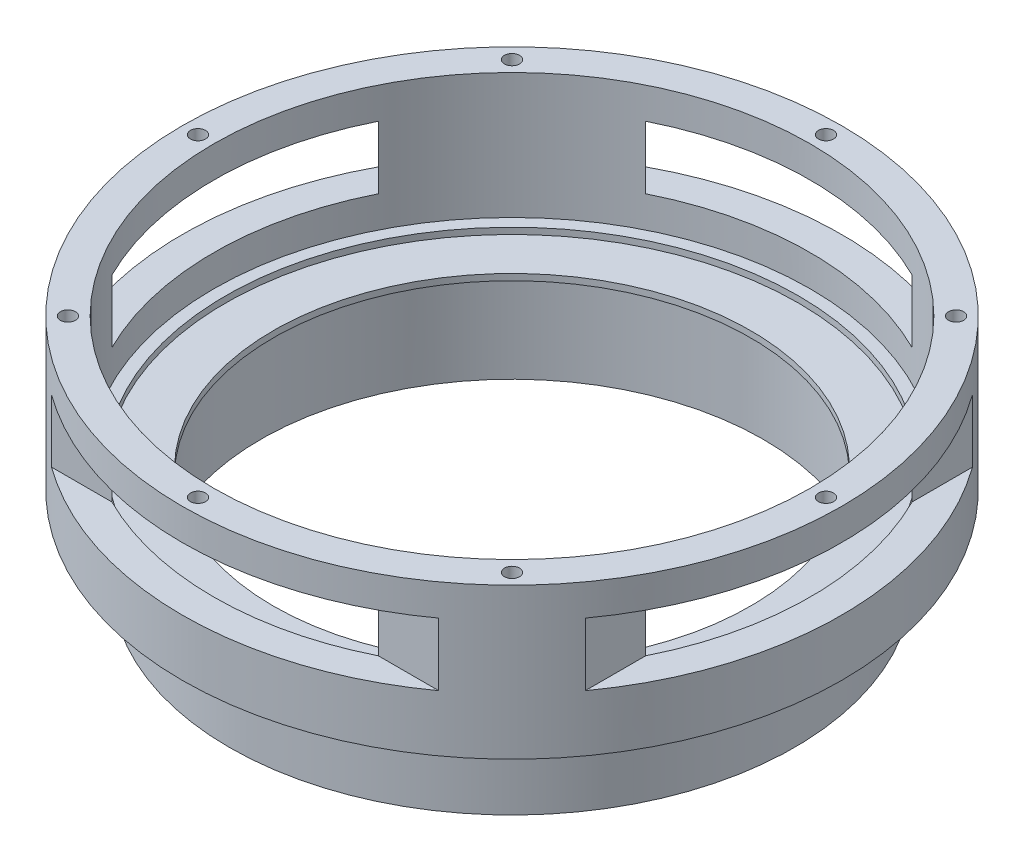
ISO-10303-21;
HEADER;
FILE_DESCRIPTION(('STEP AP214'),'2;1');
FILE_NAME('part.step','',(''),(''),'','','');
FILE_SCHEMA(('AUTOMOTIVE_DESIGN { 1 0 10303 214 1 1 1 1 }'));
ENDSEC;
DATA;
#1=APPLICATION_CONTEXT('core data for automotive mechanical design processes');
#2=APPLICATION_PROTOCOL_DEFINITION('international standard','automotive_design',2000,#1);
#3=PRODUCT_CONTEXT('',#1,'mechanical');
#4=PRODUCT('Part','Part','',(#3));
#5=PRODUCT_RELATED_PRODUCT_CATEGORY('part','',(#4));
#6=PRODUCT_DEFINITION_FORMATION('','',#4);
#7=PRODUCT_DEFINITION_CONTEXT('part definition',#1,'design');
#8=PRODUCT_DEFINITION('design','',#6,#7);
#9=PRODUCT_DEFINITION_SHAPE('','',#8);
#10=(LENGTH_UNIT() NAMED_UNIT(*) SI_UNIT(.MILLI.,.METRE.));
#11=(NAMED_UNIT(*) PLANE_ANGLE_UNIT() SI_UNIT($,.RADIAN.));
#12=(NAMED_UNIT(*) SI_UNIT($,.STERADIAN.) SOLID_ANGLE_UNIT());
#13=UNCERTAINTY_MEASURE_WITH_UNIT(LENGTH_MEASURE(1.E-05),#10,'distance_accuracy_value','');
#14=(GEOMETRIC_REPRESENTATION_CONTEXT(3) GLOBAL_UNCERTAINTY_ASSIGNED_CONTEXT((#13)) GLOBAL_UNIT_ASSIGNED_CONTEXT((#10,
#11,#12)) REPRESENTATION_CONTEXT('',''));
#15=CARTESIAN_POINT('',(0.,0.,0.));
#16=DIRECTION('',(0.,0.,1.));
#17=DIRECTION('',(1.,0.,0.));
#18=AXIS2_PLACEMENT_3D('',#15,#16,#17);
#19=CARTESIAN_POINT('',(0.,16.51,0.));
#20=DIRECTION('',(0.,1.,0.));
#21=DIRECTION('',(0.,0.,1.));
#22=AXIS2_PLACEMENT_3D('',#19,#20,#21);
#23=PLANE('',#22);
#24=CARTESIAN_POINT('',(-44.9012806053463,16.51,44.9012806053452));
#25=DIRECTION('',(0.,-1.,0.));
#26=DIRECTION('',(0.,0.,-1.));
#27=AXIS2_PLACEMENT_3D('',#24,#25,#26);
#28=CIRCLE('',#27,1.524);
#29=CARTESIAN_POINT('',(-44.9012806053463,16.51,43.3772806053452));
#30=VERTEX_POINT('',#29);
#31=EDGE_CURVE('E224',#30,#30,#28,.T.);
#32=ORIENTED_EDGE('',*,*,#31,.F.);
#33=EDGE_LOOP('',(#32));
#34=FACE_BOUND('',#33,.T.);
#35=CARTESIAN_POINT('',(-6.65127580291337E-13,16.51,63.5));
#36=DIRECTION('',(0.,-1.,0.));
#37=DIRECTION('',(0.,0.,-1.));
#38=AXIS2_PLACEMENT_3D('',#35,#36,#37);
#39=CIRCLE('',#38,1.524);
#40=CARTESIAN_POINT('',(-6.65127580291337E-13,16.51,61.976));
#41=VERTEX_POINT('',#40);
#42=EDGE_CURVE('E223',#41,#41,#39,.T.);
#43=ORIENTED_EDGE('',*,*,#42,.F.);
#44=EDGE_LOOP('',(#43));
#45=FACE_BOUND('',#44,.T.);
#46=CARTESIAN_POINT('',(44.9012806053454,16.51,44.9012806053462));
#47=DIRECTION('',(0.,-1.,0.));
#48=DIRECTION('',(0.,0.,-1.));
#49=AXIS2_PLACEMENT_3D('',#46,#47,#48);
#50=CIRCLE('',#49,1.524);
#51=CARTESIAN_POINT('',(44.9012806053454,16.51,43.3772806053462));
#52=VERTEX_POINT('',#51);
#53=EDGE_CURVE('E234',#52,#52,#50,.T.);
#54=ORIENTED_EDGE('',*,*,#53,.F.);
#55=EDGE_LOOP('',(#54));
#56=FACE_BOUND('',#55,.T.);
#57=CARTESIAN_POINT('',(63.5,16.51,4.43418386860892E-13));
#58=DIRECTION('',(0.,-1.,0.));
#59=DIRECTION('',(0.,0.,-1.));
#60=AXIS2_PLACEMENT_3D('',#57,#58,#59);
#61=CIRCLE('',#60,1.524);
#62=CARTESIAN_POINT('',(63.5,16.51,-1.52399999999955));
#63=VERTEX_POINT('',#62);
#64=EDGE_CURVE('E240',#63,#63,#61,.T.);
#65=ORIENTED_EDGE('',*,*,#64,.F.);
#66=EDGE_LOOP('',(#65));
#67=FACE_BOUND('',#66,.T.);
#68=CARTESIAN_POINT('',(44.901280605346,16.51,-44.9012806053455));
#69=DIRECTION('',(0.,-1.,0.));
#70=DIRECTION('',(0.,0.,-1.));
#71=AXIS2_PLACEMENT_3D('',#68,#69,#70);
#72=CIRCLE('',#71,1.524);
#73=CARTESIAN_POINT('',(44.901280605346,16.51,-46.4252806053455));
#74=VERTEX_POINT('',#73);
#75=EDGE_CURVE('E246',#74,#74,#72,.T.);
#76=ORIENTED_EDGE('',*,*,#75,.F.);
#77=EDGE_LOOP('',(#76));
#78=FACE_BOUND('',#77,.T.);
#79=CARTESIAN_POINT('',(2.21709193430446E-13,16.51,-63.5));
#80=DIRECTION('',(0.,-1.,0.));
#81=DIRECTION('',(0.,0.,-1.));
#82=AXIS2_PLACEMENT_3D('',#79,#80,#81);
#83=CIRCLE('',#82,1.524);
#84=CARTESIAN_POINT('',(2.21709193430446E-13,16.51,-65.024));
#85=VERTEX_POINT('',#84);
#86=EDGE_CURVE('E252',#85,#85,#83,.T.);
#87=ORIENTED_EDGE('',*,*,#86,.F.);
#88=EDGE_LOOP('',(#87));
#89=FACE_BOUND('',#88,.T.);
#90=CARTESIAN_POINT('',(0.,16.51,0.));
#91=DIRECTION('',(0.,1.,0.));
#92=DIRECTION('',(0.,0.,1.));
#93=AXIS2_PLACEMENT_3D('',#90,#91,#92);
#94=CIRCLE('',#93,66.675);
#95=CARTESIAN_POINT('',(0.,16.51,66.675));
#96=VERTEX_POINT('',#95);
#97=EDGE_CURVE('E437',#96,#96,#94,.T.);
#98=ORIENTED_EDGE('',*,*,#97,.F.);
#99=EDGE_LOOP('',(#98));
#100=FACE_BOUND('',#99,.T.);
#101=CARTESIAN_POINT('',(0.,16.51,0.));
#102=DIRECTION('',(0.,1.,0.));
#103=DIRECTION('',(0.,0.,1.));
#104=AXIS2_PLACEMENT_3D('',#101,#102,#103);
#105=CIRCLE('',#104,57.15);
#106=CARTESIAN_POINT('',(0.,16.51,57.15));
#107=VERTEX_POINT('',#106);
#108=EDGE_CURVE('E434',#107,#107,#105,.F.);
#109=ORIENTED_EDGE('',*,*,#108,.F.);
#110=EDGE_LOOP('',(#109));
#111=FACE_BOUND('',#110,.T.);
#112=CARTESIAN_POINT('',(-63.5,16.51,0.));
#113=DIRECTION('',(0.,-1.,0.));
#114=DIRECTION('',(0.,0.,-1.));
#115=AXIS2_PLACEMENT_3D('',#112,#113,#114);
#116=CIRCLE('',#115,1.524);
#117=CARTESIAN_POINT('',(-63.5,16.51,-1.524));
#118=VERTEX_POINT('',#117);
#119=EDGE_CURVE('E264',#118,#118,#116,.T.);
#120=ORIENTED_EDGE('',*,*,#119,.F.);
#121=EDGE_LOOP('',(#120));
#122=FACE_BOUND('',#121,.T.);
#123=CARTESIAN_POINT('',(-44.9012806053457,16.51,-44.9012806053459));
#124=DIRECTION('',(0.,-1.,0.));
#125=DIRECTION('',(0.,0.,-1.));
#126=AXIS2_PLACEMENT_3D('',#123,#124,#125);
#127=CIRCLE('',#126,1.524);
#128=CARTESIAN_POINT('',(-44.9012806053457,16.51,-46.4252806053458));
#129=VERTEX_POINT('',#128);
#130=EDGE_CURVE('E258',#129,#129,#127,.T.);
#131=ORIENTED_EDGE('',*,*,#130,.F.);
#132=EDGE_LOOP('',(#131));
#133=FACE_BOUND('',#132,.T.);
#134=ADVANCED_FACE('F39',(#34,#45,#56,#67,#78,#89,#100,#111,#122,#133),#23,.F.);
#135=CARTESIAN_POINT('',(0.,0.,0.));
#136=DIRECTION('',(0.,1.,0.));
#137=DIRECTION('',(0.,0.,1.));
#138=AXIS2_PLACEMENT_3D('',#135,#136,#137);
#139=PLANE('',#138);
#140=CARTESIAN_POINT('',(-38.1660885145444,0.,38.1660885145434));
#141=DIRECTION('',(0.,-1.,0.));
#142=DIRECTION('',(0.,0.,-1.));
#143=AXIS2_PLACEMENT_3D('',#140,#141,#142);
#144=CIRCLE('',#143,1.524);
#145=CARTESIAN_POINT('',(-38.1660885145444,0.,36.6420885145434));
#146=VERTEX_POINT('',#145);
#147=EDGE_CURVE('E270',#146,#146,#144,.T.);
#148=ORIENTED_EDGE('',*,*,#147,.F.);
#149=EDGE_LOOP('',(#148));
#150=FACE_BOUND('',#149,.T.);
#151=CARTESIAN_POINT('',(-5.65358443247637E-13,0.,53.975));
#152=DIRECTION('',(0.,-1.,0.));
#153=DIRECTION('',(0.,0.,-1.));
#154=AXIS2_PLACEMENT_3D('',#151,#152,#153);
#155=CIRCLE('',#154,1.524);
#156=CARTESIAN_POINT('',(-5.65358443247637E-13,0.,52.451));
#157=VERTEX_POINT('',#156);
#158=EDGE_CURVE('E276',#157,#157,#155,.T.);
#159=ORIENTED_EDGE('',*,*,#158,.F.);
#160=EDGE_LOOP('',(#159));
#161=FACE_BOUND('',#160,.T.);
#162=CARTESIAN_POINT('',(38.1660885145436,0.,38.1660885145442));
#163=DIRECTION('',(0.,-1.,0.));
#164=DIRECTION('',(0.,0.,-1.));
#165=AXIS2_PLACEMENT_3D('',#162,#163,#164);
#166=CIRCLE('',#165,1.524);
#167=CARTESIAN_POINT('',(38.1660885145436,0.,36.6420885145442));
#168=VERTEX_POINT('',#167);
#169=EDGE_CURVE('E282',#168,#168,#166,.T.);
#170=ORIENTED_EDGE('',*,*,#169,.F.);
#171=EDGE_LOOP('',(#170));
#172=FACE_BOUND('',#171,.T.);
#173=CARTESIAN_POINT('',(53.975,0.,3.76905628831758E-13));
#174=DIRECTION('',(0.,-1.,0.));
#175=DIRECTION('',(0.,0.,-1.));
#176=AXIS2_PLACEMENT_3D('',#173,#174,#175);
#177=CIRCLE('',#176,1.524);
#178=CARTESIAN_POINT('',(53.975,0.,-1.52399999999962));
#179=VERTEX_POINT('',#178);
#180=EDGE_CURVE('E288',#179,#179,#177,.T.);
#181=ORIENTED_EDGE('',*,*,#180,.F.);
#182=EDGE_LOOP('',(#181));
#183=FACE_BOUND('',#182,.T.);
#184=CARTESIAN_POINT('',(38.1660885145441,0.,-38.1660885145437));
#185=DIRECTION('',(0.,-1.,0.));
#186=DIRECTION('',(0.,0.,-1.));
#187=AXIS2_PLACEMENT_3D('',#184,#185,#186);
#188=CIRCLE('',#187,1.524);
#189=CARTESIAN_POINT('',(38.1660885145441,0.,-39.6900885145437));
#190=VERTEX_POINT('',#189);
#191=EDGE_CURVE('E294',#190,#190,#188,.T.);
#192=ORIENTED_EDGE('',*,*,#191,.F.);
#193=EDGE_LOOP('',(#192));
#194=FACE_BOUND('',#193,.T.);
#195=CARTESIAN_POINT('',(1.88452814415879E-13,0.,-53.975));
#196=DIRECTION('',(0.,-1.,0.));
#197=DIRECTION('',(0.,0.,-1.));
#198=AXIS2_PLACEMENT_3D('',#195,#196,#197);
#199=CIRCLE('',#198,1.524);
#200=CARTESIAN_POINT('',(1.88452814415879E-13,0.,-55.499));
#201=VERTEX_POINT('',#200);
#202=EDGE_CURVE('E300',#201,#201,#199,.T.);
#203=ORIENTED_EDGE('',*,*,#202,.F.);
#204=EDGE_LOOP('',(#203));
#205=FACE_BOUND('',#204,.T.);
#206=CARTESIAN_POINT('',(-38.1660885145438,0.,-38.166088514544));
#207=DIRECTION('',(0.,-1.,0.));
#208=DIRECTION('',(0.,0.,-1.));
#209=AXIS2_PLACEMENT_3D('',#206,#207,#208);
#210=CIRCLE('',#209,1.524);
#211=CARTESIAN_POINT('',(-38.1660885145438,0.,-39.690088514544));
#212=VERTEX_POINT('',#211);
#213=EDGE_CURVE('E306',#212,#212,#210,.T.);
#214=ORIENTED_EDGE('',*,*,#213,.F.);
#215=EDGE_LOOP('',(#214));
#216=FACE_BOUND('',#215,.T.);
#217=CARTESIAN_POINT('',(0.,0.,0.));
#218=DIRECTION('',(0.,-1.,0.));
#219=DIRECTION('',(0.,0.,-1.));
#220=AXIS2_PLACEMENT_3D('',#217,#218,#219);
#221=CIRCLE('',#220,57.15);
#222=CARTESIAN_POINT('',(0.,0.,-57.15));
#223=VERTEX_POINT('',#222);
#224=EDGE_CURVE('E431',#223,#223,#221,.T.);
#225=ORIENTED_EDGE('',*,*,#224,.T.);
#226=EDGE_LOOP('',(#225));
#227=FACE_BOUND('',#226,.T.);
#228=CARTESIAN_POINT('',(0.,0.,0.));
#229=DIRECTION('',(0.,-1.,0.));
#230=DIRECTION('',(0.,0.,-1.));
#231=AXIS2_PLACEMENT_3D('',#228,#229,#230);
#232=CIRCLE('',#231,50.8);
#233=CARTESIAN_POINT('',(0.,0.,-50.8));
#234=VERTEX_POINT('',#233);
#235=EDGE_CURVE('E438',#234,#234,#232,.T.);
#236=ORIENTED_EDGE('',*,*,#235,.F.);
#237=EDGE_LOOP('',(#236));
#238=FACE_BOUND('',#237,.T.);
#239=CARTESIAN_POINT('',(-53.975,0.,0.));
#240=DIRECTION('',(0.,-1.,0.));
#241=DIRECTION('',(0.,0.,-1.));
#242=AXIS2_PLACEMENT_3D('',#239,#240,#241);
#243=CIRCLE('',#242,1.524);
#244=CARTESIAN_POINT('',(-53.975,0.,-1.524));
#245=VERTEX_POINT('',#244);
#246=EDGE_CURVE('E312',#245,#245,#243,.T.);
#247=ORIENTED_EDGE('',*,*,#246,.F.);
#248=EDGE_LOOP('',(#247));
#249=FACE_BOUND('',#248,.T.);
#250=ADVANCED_FACE('F530',(#150,#161,#172,#183,#194,#205,#216,#227,#238,#249),#139,.F.);
#251=CARTESIAN_POINT('',(0.,46.99,0.));
#252=DIRECTION('',(0.,-1.,0.));
#253=DIRECTION('',(0.,0.,-1.));
#254=AXIS2_PLACEMENT_3D('',#251,#252,#253);
#255=CYLINDRICAL_SURFACE('',#254,48.26);
#256=CARTESIAN_POINT('',(0.,19.05,0.));
#257=DIRECTION('',(0.,1.,0.));
#258=DIRECTION('',(0.,0.,1.));
#259=AXIS2_PLACEMENT_3D('',#256,#257,#258);
#260=CIRCLE('',#259,48.26);
#261=CARTESIAN_POINT('',(0.,19.05,48.26));
#262=VERTEX_POINT('',#261);
#263=EDGE_CURVE('E444',#262,#262,#260,.F.);
#264=ORIENTED_EDGE('',*,*,#263,.T.);
#265=EDGE_LOOP('',(#264));
#266=FACE_BOUND('',#265,.T.);
#267=CARTESIAN_POINT('',(0.,20.32,0.));
#268=DIRECTION('',(0.,1.,0.));
#269=DIRECTION('',(0.,0.,1.));
#270=AXIS2_PLACEMENT_3D('',#267,#268,#269);
#271=CIRCLE('',#270,48.26);
#272=CARTESIAN_POINT('',(0.,20.32,48.26));
#273=VERTEX_POINT('',#272);
#274=EDGE_CURVE('E43',#273,#273,#271,.F.);
#275=ORIENTED_EDGE('',*,*,#274,.F.);
#276=EDGE_LOOP('',(#275));
#277=FACE_BOUND('',#276,.T.);
#278=ADVANCED_FACE('F536',(#266,#277),#255,.F.);
#279=CARTESIAN_POINT('',(0.,46.99,0.));
#280=DIRECTION('',(0.,-1.,0.));
#281=DIRECTION('',(0.,0.,-1.));
#282=AXIS2_PLACEMENT_3D('',#279,#280,#281);
#283=CYLINDRICAL_SURFACE('',#282,66.675);
#284=CARTESIAN_POINT('',(0.,40.64,0.));
#285=DIRECTION('',(0.,1.,0.));
#286=DIRECTION('',(0.,0.,1.));
#287=AXIS2_PLACEMENT_3D('',#284,#285,#286);
#288=CIRCLE('',#287,66.675);
#289=CARTESIAN_POINT('',(-39.144028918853,40.64,53.975));
#290=VERTEX_POINT('',#289);
#291=CARTESIAN_POINT('',(39.144028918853,40.64,53.975));
#292=VERTEX_POINT('',#291);
#293=EDGE_CURVE('E375',#290,#292,#288,.T.);
#294=ORIENTED_EDGE('',*,*,#293,.T.);
#295=DIRECTION('',(0.,-1.,0.));
#296=VECTOR('',#295,1.);
#297=CARTESIAN_POINT('',(39.144028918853,46.99,53.975));
#298=LINE('',#297,#296);
#299=CARTESIAN_POINT('',(39.144028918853,27.94,53.975));
#300=VERTEX_POINT('',#299);
#301=EDGE_CURVE('E373',#292,#300,#298,.T.);
#302=ORIENTED_EDGE('',*,*,#301,.T.);
#303=CARTESIAN_POINT('',(0.,27.94,0.));
#304=DIRECTION('',(0.,-1.,0.));
#305=DIRECTION('',(0.,0.,-1.));
#306=AXIS2_PLACEMENT_3D('',#303,#304,#305);
#307=CIRCLE('',#306,66.675);
#308=CARTESIAN_POINT('',(-39.144028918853,27.94,53.975));
#309=VERTEX_POINT('',#308);
#310=EDGE_CURVE('E56',#300,#309,#307,.T.);
#311=ORIENTED_EDGE('',*,*,#310,.T.);
#312=DIRECTION('',(0.,-1.,0.));
#313=VECTOR('',#312,1.);
#314=CARTESIAN_POINT('',(-39.144028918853,46.99,53.975));
#315=LINE('',#314,#313);
#316=EDGE_CURVE('E371',#309,#290,#315,.F.);
#317=ORIENTED_EDGE('',*,*,#316,.T.);
#318=EDGE_LOOP('',(#294,#302,#311,#317));
#319=FACE_BOUND('',#318,.T.);
#320=CARTESIAN_POINT('',(0.,27.94,0.));
#321=DIRECTION('',(0.,-1.,0.));
#322=DIRECTION('',(0.,0.,-1.));
#323=AXIS2_PLACEMENT_3D('',#320,#321,#322);
#324=CIRCLE('',#323,66.675);
#325=CARTESIAN_POINT('',(-39.144028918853,27.94,-53.975));
#326=VERTEX_POINT('',#325);
#327=CARTESIAN_POINT('',(39.144028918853,27.94,-53.975));
#328=VERTEX_POINT('',#327);
#329=EDGE_CURVE('E393',#326,#328,#324,.T.);
#330=ORIENTED_EDGE('',*,*,#329,.T.);
#331=DIRECTION('',(0.,-1.,0.));
#332=VECTOR('',#331,1.);
#333=CARTESIAN_POINT('',(39.144028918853,46.99,-53.975));
#334=LINE('',#333,#332);
#335=CARTESIAN_POINT('',(39.144028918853,40.64,-53.975));
#336=VERTEX_POINT('',#335);
#337=EDGE_CURVE('E387',#328,#336,#334,.F.);
#338=ORIENTED_EDGE('',*,*,#337,.T.);
#339=CARTESIAN_POINT('',(0.,40.64,0.));
#340=DIRECTION('',(0.,1.,0.));
#341=DIRECTION('',(0.,0.,1.));
#342=AXIS2_PLACEMENT_3D('',#339,#340,#341);
#343=CIRCLE('',#342,66.675);
#344=CARTESIAN_POINT('',(-39.144028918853,40.64,-53.975));
#345=VERTEX_POINT('',#344);
#346=EDGE_CURVE('E385',#336,#345,#343,.T.);
#347=ORIENTED_EDGE('',*,*,#346,.T.);
#348=DIRECTION('',(0.,-1.,0.));
#349=VECTOR('',#348,1.);
#350=CARTESIAN_POINT('',(-39.144028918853,46.99,-53.975));
#351=LINE('',#350,#349);
#352=EDGE_CURVE('E390',#345,#326,#351,.T.);
#353=ORIENTED_EDGE('',*,*,#352,.T.);
#354=EDGE_LOOP('',(#330,#338,#347,#353));
#355=FACE_BOUND('',#354,.T.);
#356=DIRECTION('',(0.,-1.,0.));
#357=VECTOR('',#356,1.);
#358=CARTESIAN_POINT('',(-53.975,46.99,-39.144028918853));
#359=LINE('',#358,#357);
#360=CARTESIAN_POINT('',(-53.975,27.94,-39.144028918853));
#361=VERTEX_POINT('',#360);
#362=CARTESIAN_POINT('',(-53.975,40.64,-39.144028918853));
#363=VERTEX_POINT('',#362);
#364=EDGE_CURVE('E405',#361,#363,#359,.F.);
#365=ORIENTED_EDGE('',*,*,#364,.T.);
#366=CARTESIAN_POINT('',(0.,40.64,0.));
#367=DIRECTION('',(0.,1.,0.));
#368=DIRECTION('',(0.,0.,1.));
#369=AXIS2_PLACEMENT_3D('',#366,#367,#368);
#370=CIRCLE('',#369,66.675);
#371=CARTESIAN_POINT('',(-53.975,40.64,39.144028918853));
#372=VERTEX_POINT('',#371);
#373=EDGE_CURVE('E411',#363,#372,#370,.T.);
#374=ORIENTED_EDGE('',*,*,#373,.T.);
#375=DIRECTION('',(0.,-1.,0.));
#376=VECTOR('',#375,1.);
#377=CARTESIAN_POINT('',(-53.975,46.99,39.144028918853));
#378=LINE('',#377,#376);
#379=CARTESIAN_POINT('',(-53.975,27.94,39.144028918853));
#380=VERTEX_POINT('',#379);
#381=EDGE_CURVE('E408',#372,#380,#378,.T.);
#382=ORIENTED_EDGE('',*,*,#381,.T.);
#383=CARTESIAN_POINT('',(0.,27.94,0.));
#384=DIRECTION('',(0.,-1.,0.));
#385=DIRECTION('',(0.,0.,-1.));
#386=AXIS2_PLACEMENT_3D('',#383,#384,#385);
#387=CIRCLE('',#386,66.675);
#388=EDGE_CURVE('E403',#380,#361,#387,.T.);
#389=ORIENTED_EDGE('',*,*,#388,.T.);
#390=EDGE_LOOP('',(#365,#374,#382,#389));
#391=FACE_BOUND('',#390,.T.);
#392=DIRECTION('',(0.,-1.,0.));
#393=VECTOR('',#392,1.);
#394=CARTESIAN_POINT('',(53.975,46.99,-39.144028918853));
#395=LINE('',#394,#393);
#396=CARTESIAN_POINT('',(53.975,40.64,-39.144028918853));
#397=VERTEX_POINT('',#396);
#398=CARTESIAN_POINT('',(53.975,27.94,-39.144028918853));
#399=VERTEX_POINT('',#398);
#400=EDGE_CURVE('E426',#397,#399,#395,.T.);
#401=ORIENTED_EDGE('',*,*,#400,.T.);
#402=CARTESIAN_POINT('',(0.,27.94,0.));
#403=DIRECTION('',(0.,-1.,0.));
#404=DIRECTION('',(0.,0.,-1.));
#405=AXIS2_PLACEMENT_3D('',#402,#403,#404);
#406=CIRCLE('',#405,66.675);
#407=CARTESIAN_POINT('',(53.975,27.94,39.144028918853));
#408=VERTEX_POINT('',#407);
#409=EDGE_CURVE('E429',#399,#408,#406,.T.);
#410=ORIENTED_EDGE('',*,*,#409,.T.);
#411=DIRECTION('',(0.,-1.,0.));
#412=VECTOR('',#411,1.);
#413=CARTESIAN_POINT('',(53.975,46.99,39.144028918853));
#414=LINE('',#413,#412);
#415=CARTESIAN_POINT('',(53.975,40.64,39.144028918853));
#416=VERTEX_POINT('',#415);
#417=EDGE_CURVE('E423',#408,#416,#414,.F.);
#418=ORIENTED_EDGE('',*,*,#417,.T.);
#419=CARTESIAN_POINT('',(0.,40.64,0.));
#420=DIRECTION('',(0.,1.,0.));
#421=DIRECTION('',(0.,0.,1.));
#422=AXIS2_PLACEMENT_3D('',#419,#420,#421);
#423=CIRCLE('',#422,66.675);
#424=EDGE_CURVE('E421',#416,#397,#423,.T.);
#425=ORIENTED_EDGE('',*,*,#424,.T.);
#426=EDGE_LOOP('',(#401,#410,#418,#425));
#427=FACE_BOUND('',#426,.T.);
#428=ORIENTED_EDGE('',*,*,#97,.T.);
#429=EDGE_LOOP('',(#428));
#430=FACE_BOUND('',#429,.T.);
#431=CARTESIAN_POINT('',(0.,46.99,0.));
#432=DIRECTION('',(0.,1.,0.));
#433=DIRECTION('',(0.,0.,1.));
#434=AXIS2_PLACEMENT_3D('',#431,#432,#433);
#435=CIRCLE('',#434,66.675);
#436=CARTESIAN_POINT('',(0.,46.99,66.675));
#437=VERTEX_POINT('',#436);
#438=EDGE_CURVE('E448',#437,#437,#435,.T.);
#439=ORIENTED_EDGE('',*,*,#438,.F.);
#440=EDGE_LOOP('',(#439));
#441=FACE_BOUND('',#440,.T.);
#442=ADVANCED_FACE('F41',(#319,#355,#391,#427,#430,#441),#283,.T.);
#443=CARTESIAN_POINT('',(0.,46.99,0.));
#444=DIRECTION('',(0.,1.,0.));
#445=DIRECTION('',(0.,0.,1.));
#446=AXIS2_PLACEMENT_3D('',#443,#444,#445);
#447=PLANE('',#446);
#448=CARTESIAN_POINT('',(-44.9012806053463,46.99,44.9012806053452));
#449=DIRECTION('',(0.,1.,0.));
#450=DIRECTION('',(0.,0.,1.));
#451=AXIS2_PLACEMENT_3D('',#448,#449,#450);
#452=CIRCLE('',#451,1.524);
#453=CARTESIAN_POINT('',(-44.9012806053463,46.99,46.4252806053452));
#454=VERTEX_POINT('',#453);
#455=EDGE_CURVE('E324',#454,#454,#452,.T.);
#456=ORIENTED_EDGE('',*,*,#455,.F.);
#457=EDGE_LOOP('',(#456));
#458=FACE_BOUND('',#457,.T.);
#459=CARTESIAN_POINT('',(-6.65127580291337E-13,46.99,63.5));
#460=DIRECTION('',(0.,1.,0.));
#461=DIRECTION('',(0.,0.,1.));
#462=AXIS2_PLACEMENT_3D('',#459,#460,#461);
#463=CIRCLE('',#462,1.524);
#464=CARTESIAN_POINT('',(-6.65127580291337E-13,46.99,65.024));
#465=VERTEX_POINT('',#464);
#466=EDGE_CURVE('E330',#465,#465,#463,.T.);
#467=ORIENTED_EDGE('',*,*,#466,.F.);
#468=EDGE_LOOP('',(#467));
#469=FACE_BOUND('',#468,.T.);
#470=CARTESIAN_POINT('',(44.9012806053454,46.99,44.9012806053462));
#471=DIRECTION('',(0.,1.,0.));
#472=DIRECTION('',(0.,0.,1.));
#473=AXIS2_PLACEMENT_3D('',#470,#471,#472);
#474=CIRCLE('',#473,1.524);
#475=CARTESIAN_POINT('',(44.9012806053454,46.99,46.4252806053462));
#476=VERTEX_POINT('',#475);
#477=EDGE_CURVE('E334',#476,#476,#474,.T.);
#478=ORIENTED_EDGE('',*,*,#477,.F.);
#479=EDGE_LOOP('',(#478));
#480=FACE_BOUND('',#479,.T.);
#481=CARTESIAN_POINT('',(63.5,46.99,4.43418386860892E-13));
#482=DIRECTION('',(0.,1.,0.));
#483=DIRECTION('',(0.,0.,1.));
#484=AXIS2_PLACEMENT_3D('',#481,#482,#483);
#485=CIRCLE('',#484,1.524);
#486=CARTESIAN_POINT('',(63.5,46.99,1.52400000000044));
#487=VERTEX_POINT('',#486);
#488=EDGE_CURVE('E340',#487,#487,#485,.T.);
#489=ORIENTED_EDGE('',*,*,#488,.F.);
#490=EDGE_LOOP('',(#489));
#491=FACE_BOUND('',#490,.T.);
#492=CARTESIAN_POINT('',(44.901280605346,46.99,-44.9012806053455));
#493=DIRECTION('',(0.,1.,0.));
#494=DIRECTION('',(0.,0.,1.));
#495=AXIS2_PLACEMENT_3D('',#492,#493,#494);
#496=CIRCLE('',#495,1.524);
#497=CARTESIAN_POINT('',(44.901280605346,46.99,-43.3772806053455));
#498=VERTEX_POINT('',#497);
#499=EDGE_CURVE('E344',#498,#498,#496,.T.);
#500=ORIENTED_EDGE('',*,*,#499,.F.);
#501=EDGE_LOOP('',(#500));
#502=FACE_BOUND('',#501,.T.);
#503=CARTESIAN_POINT('',(2.21709193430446E-13,46.99,-63.5));
#504=DIRECTION('',(0.,1.,0.));
#505=DIRECTION('',(0.,0.,1.));
#506=AXIS2_PLACEMENT_3D('',#503,#504,#505);
#507=CIRCLE('',#506,1.524);
#508=CARTESIAN_POINT('',(2.21709193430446E-13,46.99,-61.976));
#509=VERTEX_POINT('',#508);
#510=EDGE_CURVE('E350',#509,#509,#507,.T.);
#511=ORIENTED_EDGE('',*,*,#510,.F.);
#512=EDGE_LOOP('',(#511));
#513=FACE_BOUND('',#512,.T.);
#514=CARTESIAN_POINT('',(-44.9012806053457,46.99,-44.9012806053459));
#515=DIRECTION('',(0.,1.,0.));
#516=DIRECTION('',(0.,0.,1.));
#517=AXIS2_PLACEMENT_3D('',#514,#515,#516);
#518=CIRCLE('',#517,1.524);
#519=CARTESIAN_POINT('',(-44.9012806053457,46.99,-43.3772806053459));
#520=VERTEX_POINT('',#519);
#521=EDGE_CURVE('E354',#520,#520,#518,.T.);
#522=ORIENTED_EDGE('',*,*,#521,.F.);
#523=EDGE_LOOP('',(#522));
#524=FACE_BOUND('',#523,.T.);
#525=CARTESIAN_POINT('',(-63.5,46.99,0.));
#526=DIRECTION('',(0.,1.,0.));
#527=DIRECTION('',(0.,0.,1.));
#528=AXIS2_PLACEMENT_3D('',#525,#526,#527);
#529=CIRCLE('',#528,1.524);
#530=CARTESIAN_POINT('',(-63.5,46.99,1.524));
#531=VERTEX_POINT('',#530);
#532=EDGE_CURVE('E360',#531,#531,#529,.T.);
#533=ORIENTED_EDGE('',*,*,#532,.F.);
#534=EDGE_LOOP('',(#533));
#535=FACE_BOUND('',#534,.T.);
#536=CARTESIAN_POINT('',(0.,46.99,0.));
#537=DIRECTION('',(0.,1.,0.));
#538=DIRECTION('',(0.,0.,1.));
#539=AXIS2_PLACEMENT_3D('',#536,#537,#538);
#540=CIRCLE('',#539,60.325);
#541=CARTESIAN_POINT('',(0.,46.99,60.325));
#542=VERTEX_POINT('',#541);
#543=EDGE_CURVE('E449',#542,#542,#540,.T.);
#544=ORIENTED_EDGE('',*,*,#543,.F.);
#545=EDGE_LOOP('',(#544));
#546=FACE_BOUND('',#545,.T.);
#547=ORIENTED_EDGE('',*,*,#438,.T.);
#548=EDGE_LOOP('',(#547));
#549=FACE_BOUND('',#548,.T.);
#550=ADVANCED_FACE('F562',(#458,#469,#480,#491,#502,#513,#524,#535,#546,#549),#447,.T.);
#551=CARTESIAN_POINT('',(0.,21.59,0.));
#552=DIRECTION('',(0.,1.,0.));
#553=DIRECTION('',(0.,0.,1.));
#554=AXIS2_PLACEMENT_3D('',#551,#552,#553);
#555=CYLINDRICAL_SURFACE('',#554,60.325);
#556=DIRECTION('',(0.,1.,0.));
#557=VECTOR('',#556,1.);
#558=CARTESIAN_POINT('',(26.9407683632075,21.59,53.975));
#559=LINE('',#558,#557);
#560=CARTESIAN_POINT('',(26.9407683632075,27.94,53.975));
#561=VERTEX_POINT('',#560);
#562=CARTESIAN_POINT('',(26.9407683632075,40.64,53.975));
#563=VERTEX_POINT('',#562);
#564=EDGE_CURVE('E497',#561,#563,#559,.T.);
#565=ORIENTED_EDGE('',*,*,#564,.T.);
#566=CARTESIAN_POINT('',(0.,40.64,0.));
#567=DIRECTION('',(0.,1.,0.));
#568=DIRECTION('',(0.,0.,1.));
#569=AXIS2_PLACEMENT_3D('',#566,#567,#568);
#570=CIRCLE('',#569,60.325);
#571=CARTESIAN_POINT('',(-26.9407683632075,40.64,53.975));
#572=VERTEX_POINT('',#571);
#573=EDGE_CURVE('E13',#563,#572,#570,.F.);
#574=ORIENTED_EDGE('',*,*,#573,.T.);
#575=DIRECTION('',(0.,1.,0.));
#576=VECTOR('',#575,1.);
#577=CARTESIAN_POINT('',(-26.9407683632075,21.59,53.975));
#578=LINE('',#577,#576);
#579=CARTESIAN_POINT('',(-26.9407683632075,27.94,53.975));
#580=VERTEX_POINT('',#579);
#581=EDGE_CURVE('E48',#572,#580,#578,.F.);
#582=ORIENTED_EDGE('',*,*,#581,.T.);
#583=CARTESIAN_POINT('',(0.,27.94,0.));
#584=DIRECTION('',(0.,-1.,0.));
#585=DIRECTION('',(0.,0.,-1.));
#586=AXIS2_PLACEMENT_3D('',#583,#584,#585);
#587=CIRCLE('',#586,60.325);
#588=EDGE_CURVE('E494',#580,#561,#587,.F.);
#589=ORIENTED_EDGE('',*,*,#588,.T.);
#590=EDGE_LOOP('',(#565,#574,#582,#589));
#591=FACE_BOUND('',#590,.T.);
#592=DIRECTION('',(0.,1.,0.));
#593=VECTOR('',#592,1.);
#594=CARTESIAN_POINT('',(26.9407683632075,21.59,-53.975));
#595=LINE('',#594,#593);
#596=CARTESIAN_POINT('',(26.9407683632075,40.64,-53.975));
#597=VERTEX_POINT('',#596);
#598=CARTESIAN_POINT('',(26.9407683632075,27.94,-53.975));
#599=VERTEX_POINT('',#598);
#600=EDGE_CURVE('E488',#597,#599,#595,.F.);
#601=ORIENTED_EDGE('',*,*,#600,.T.);
#602=CARTESIAN_POINT('',(0.,27.94,0.));
#603=DIRECTION('',(0.,-1.,0.));
#604=DIRECTION('',(0.,0.,-1.));
#605=AXIS2_PLACEMENT_3D('',#602,#603,#604);
#606=CIRCLE('',#605,60.325);
#607=CARTESIAN_POINT('',(-26.9407683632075,27.94,-53.975));
#608=VERTEX_POINT('',#607);
#609=EDGE_CURVE('E491',#599,#608,#606,.F.);
#610=ORIENTED_EDGE('',*,*,#609,.T.);
#611=DIRECTION('',(0.,1.,0.));
#612=VECTOR('',#611,1.);
#613=CARTESIAN_POINT('',(-26.9407683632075,21.59,-53.975));
#614=LINE('',#613,#612);
#615=CARTESIAN_POINT('',(-26.9407683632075,40.64,-53.975));
#616=VERTEX_POINT('',#615);
#617=EDGE_CURVE('E485',#608,#616,#614,.T.);
#618=ORIENTED_EDGE('',*,*,#617,.T.);
#619=CARTESIAN_POINT('',(0.,40.64,0.));
#620=DIRECTION('',(0.,1.,0.));
#621=DIRECTION('',(0.,0.,1.));
#622=AXIS2_PLACEMENT_3D('',#619,#620,#621);
#623=CIRCLE('',#622,60.325);
#624=EDGE_CURVE('E482',#616,#597,#623,.F.);
#625=ORIENTED_EDGE('',*,*,#624,.T.);
#626=EDGE_LOOP('',(#601,#610,#618,#625));
#627=FACE_BOUND('',#626,.T.);
#628=DIRECTION('',(0.,1.,0.));
#629=VECTOR('',#628,1.);
#630=CARTESIAN_POINT('',(-53.975,21.59,26.9407683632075));
#631=LINE('',#630,#629);
#632=CARTESIAN_POINT('',(-53.975,27.94,26.9407683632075));
#633=VERTEX_POINT('',#632);
#634=CARTESIAN_POINT('',(-53.975,40.64,26.9407683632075));
#635=VERTEX_POINT('',#634);
#636=EDGE_CURVE('E473',#633,#635,#631,.T.);
#637=ORIENTED_EDGE('',*,*,#636,.T.);
#638=CARTESIAN_POINT('',(0.,40.64,0.));
#639=DIRECTION('',(0.,1.,0.));
#640=DIRECTION('',(0.,0.,1.));
#641=AXIS2_PLACEMENT_3D('',#638,#639,#640);
#642=CIRCLE('',#641,60.325);
#643=CARTESIAN_POINT('',(-53.975,40.64,-26.9407683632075));
#644=VERTEX_POINT('',#643);
#645=EDGE_CURVE('E479',#635,#644,#642,.F.);
#646=ORIENTED_EDGE('',*,*,#645,.T.);
#647=DIRECTION('',(0.,1.,0.));
#648=VECTOR('',#647,1.);
#649=CARTESIAN_POINT('',(-53.975,21.59,-26.9407683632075));
#650=LINE('',#649,#648);
#651=CARTESIAN_POINT('',(-53.975,27.94,-26.9407683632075));
#652=VERTEX_POINT('',#651);
#653=EDGE_CURVE('E476',#644,#652,#650,.F.);
#654=ORIENTED_EDGE('',*,*,#653,.T.);
#655=CARTESIAN_POINT('',(0.,27.94,0.));
#656=DIRECTION('',(0.,-1.,0.));
#657=DIRECTION('',(0.,0.,-1.));
#658=AXIS2_PLACEMENT_3D('',#655,#656,#657);
#659=CIRCLE('',#658,60.325);
#660=EDGE_CURVE('E470',#652,#633,#659,.F.);
#661=ORIENTED_EDGE('',*,*,#660,.T.);
#662=EDGE_LOOP('',(#637,#646,#654,#661));
#663=FACE_BOUND('',#662,.T.);
#664=DIRECTION('',(0.,1.,0.));
#665=VECTOR('',#664,1.);
#666=CARTESIAN_POINT('',(53.975,21.59,26.9407683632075));
#667=LINE('',#666,#665);
#668=CARTESIAN_POINT('',(53.975,40.64,26.9407683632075));
#669=VERTEX_POINT('',#668);
#670=CARTESIAN_POINT('',(53.975,27.94,26.9407683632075));
#671=VERTEX_POINT('',#670);
#672=EDGE_CURVE('E464',#669,#671,#667,.F.);
#673=ORIENTED_EDGE('',*,*,#672,.T.);
#674=CARTESIAN_POINT('',(0.,27.94,0.));
#675=DIRECTION('',(0.,-1.,0.));
#676=DIRECTION('',(0.,0.,-1.));
#677=AXIS2_PLACEMENT_3D('',#674,#675,#676);
#678=CIRCLE('',#677,60.325);
#679=CARTESIAN_POINT('',(53.975,27.94,-26.9407683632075));
#680=VERTEX_POINT('',#679);
#681=EDGE_CURVE('E467',#671,#680,#678,.F.);
#682=ORIENTED_EDGE('',*,*,#681,.T.);
#683=DIRECTION('',(0.,1.,0.));
#684=VECTOR('',#683,1.);
#685=CARTESIAN_POINT('',(53.975,21.59,-26.9407683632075));
#686=LINE('',#685,#684);
#687=CARTESIAN_POINT('',(53.975,40.64,-26.9407683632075));
#688=VERTEX_POINT('',#687);
#689=EDGE_CURVE('E461',#680,#688,#686,.T.);
#690=ORIENTED_EDGE('',*,*,#689,.T.);
#691=CARTESIAN_POINT('',(0.,40.64,0.));
#692=DIRECTION('',(0.,1.,0.));
#693=DIRECTION('',(0.,0.,1.));
#694=AXIS2_PLACEMENT_3D('',#691,#692,#693);
#695=CIRCLE('',#694,60.325);
#696=EDGE_CURVE('E454',#688,#669,#695,.F.);
#697=ORIENTED_EDGE('',*,*,#696,.T.);
#698=EDGE_LOOP('',(#673,#682,#690,#697));
#699=FACE_BOUND('',#698,.T.);
#700=CARTESIAN_POINT('',(0.,21.59,0.));
#701=DIRECTION('',(0.,1.,0.));
#702=DIRECTION('',(0.,0.,1.));
#703=AXIS2_PLACEMENT_3D('',#700,#701,#702);
#704=CIRCLE('',#703,60.325);
#705=CARTESIAN_POINT('',(0.,21.59,60.325));
#706=VERTEX_POINT('',#705);
#707=EDGE_CURVE('E445',#706,#706,#704,.T.);
#708=ORIENTED_EDGE('',*,*,#707,.F.);
#709=EDGE_LOOP('',(#708));
#710=FACE_BOUND('',#709,.T.);
#711=ORIENTED_EDGE('',*,*,#543,.T.);
#712=EDGE_LOOP('',(#711));
#713=FACE_BOUND('',#712,.T.);
#714=ADVANCED_FACE('F558',(#591,#627,#663,#699,#710,#713),#555,.F.);
#715=CARTESIAN_POINT('',(0.,21.59,0.));
#716=DIRECTION('',(0.,1.,0.));
#717=DIRECTION('',(0.,0.,1.));
#718=AXIS2_PLACEMENT_3D('',#715,#716,#717);
#719=PLANE('',#718);
#720=CARTESIAN_POINT('',(0.,21.59,0.));
#721=DIRECTION('',(0.,1.,0.));
#722=DIRECTION('',(0.,0.,1.));
#723=AXIS2_PLACEMENT_3D('',#720,#721,#722);
#724=CIRCLE('',#723,57.912);
#725=CARTESIAN_POINT('',(0.,21.59,57.912));
#726=VERTEX_POINT('',#725);
#727=EDGE_CURVE('E318',#726,#726,#724,.T.);
#728=ORIENTED_EDGE('',*,*,#727,.F.);
#729=EDGE_LOOP('',(#728));
#730=FACE_BOUND('',#729,.T.);
#731=ORIENTED_EDGE('',*,*,#707,.T.);
#732=EDGE_LOOP('',(#731));
#733=FACE_BOUND('',#732,.T.);
#734=ADVANCED_FACE('F551',(#730,#733),#719,.T.);
#735=CARTESIAN_POINT('',(0.,19.05,0.));
#736=DIRECTION('',(0.,1.,0.));
#737=DIRECTION('',(0.,0.,1.));
#738=AXIS2_PLACEMENT_3D('',#735,#736,#737);
#739=PLANE('',#738);
#740=CARTESIAN_POINT('',(0.,19.05,0.));
#741=DIRECTION('',(0.,1.,0.));
#742=DIRECTION('',(0.,0.,1.));
#743=AXIS2_PLACEMENT_3D('',#740,#741,#742);
#744=CIRCLE('',#743,50.8);
#745=CARTESIAN_POINT('',(0.,19.05,50.8));
#746=VERTEX_POINT('',#745);
#747=EDGE_CURVE('E441',#746,#746,#744,.F.);
#748=ORIENTED_EDGE('',*,*,#747,.T.);
#749=EDGE_LOOP('',(#748));
#750=FACE_BOUND('',#749,.T.);
#751=ORIENTED_EDGE('',*,*,#263,.F.);
#752=EDGE_LOOP('',(#751));
#753=FACE_BOUND('',#752,.T.);
#754=ADVANCED_FACE('F547',(#750,#753),#739,.F.);
#755=CARTESIAN_POINT('',(0.,165.274097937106,0.));
#756=DIRECTION('',(0.,-1.,0.));
#757=DIRECTION('',(0.,0.,-1.));
#758=AXIS2_PLACEMENT_3D('',#755,#756,#757);
#759=CYLINDRICAL_SURFACE('',#758,50.8);
#760=ORIENTED_EDGE('',*,*,#235,.T.);
#761=EDGE_LOOP('',(#760));
#762=FACE_BOUND('',#761,.T.);
#763=ORIENTED_EDGE('',*,*,#747,.F.);
#764=EDGE_LOOP('',(#763));
#765=FACE_BOUND('',#764,.T.);
#766=ADVANCED_FACE('F544',(#762,#765),#759,.F.);
#767=CARTESIAN_POINT('',(0.,212.061232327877,0.));
#768=DIRECTION('',(0.,-1.,0.));
#769=DIRECTION('',(0.,0.,-1.));
#770=AXIS2_PLACEMENT_3D('',#767,#768,#769);
#771=CYLINDRICAL_SURFACE('',#770,57.15);
#772=ORIENTED_EDGE('',*,*,#224,.F.);
#773=EDGE_LOOP('',(#772));
#774=FACE_BOUND('',#773,.T.);
#775=ORIENTED_EDGE('',*,*,#108,.T.);
#776=EDGE_LOOP('',(#775));
#777=FACE_BOUND('',#776,.T.);
#778=ADVANCED_FACE('F542',(#774,#777),#771,.T.);
#779=CARTESIAN_POINT('',(66.675,27.94,-66.675));
#780=DIRECTION('',(0.,-1.,0.));
#781=DIRECTION('',(0.,0.,-1.));
#782=AXIS2_PLACEMENT_3D('',#779,#780,#781);
#783=PLANE('',#782);
#784=DIRECTION('',(0.,0.,1.));
#785=VECTOR('',#784,1.);
#786=CARTESIAN_POINT('',(53.975,27.94,-66.675));
#787=LINE('',#786,#785);
#788=EDGE_CURVE('E417',#399,#680,#787,.T.);
#789=ORIENTED_EDGE('',*,*,#788,.T.);
#790=ORIENTED_EDGE('',*,*,#681,.F.);
#791=EDGE_CURVE('E414',#671,#408,#787,.T.);
#792=ORIENTED_EDGE('',*,*,#791,.T.);
#793=ORIENTED_EDGE('',*,*,#409,.F.);
#794=EDGE_LOOP('',(#789,#790,#792,#793));
#795=FACE_BOUND('',#794,.T.);
#796=ADVANCED_FACE('F634',(#795),#783,.F.);
#797=CARTESIAN_POINT('',(53.975,40.64,-66.675));
#798=DIRECTION('',(-1.,0.,0.));
#799=DIRECTION('',(0.,0.,1.));
#800=AXIS2_PLACEMENT_3D('',#797,#798,#799);
#801=PLANE('',#800);
#802=DIRECTION('',(0.,0.,1.));
#803=VECTOR('',#802,1.);
#804=CARTESIAN_POINT('',(53.975,40.64,-66.675));
#805=LINE('',#804,#803);
#806=EDGE_CURVE('E418',#397,#688,#805,.T.);
#807=ORIENTED_EDGE('',*,*,#806,.T.);
#808=ORIENTED_EDGE('',*,*,#689,.F.);
#809=ORIENTED_EDGE('',*,*,#788,.F.);
#810=ORIENTED_EDGE('',*,*,#400,.F.);
#811=EDGE_LOOP('',(#807,#808,#809,#810));
#812=FACE_BOUND('',#811,.T.);
#813=ADVANCED_FACE('F637',(#812),#801,.F.);
#814=ORIENTED_EDGE('',*,*,#791,.F.);
#815=ORIENTED_EDGE('',*,*,#672,.F.);
#816=EDGE_CURVE('E413',#669,#416,#805,.T.);
#817=ORIENTED_EDGE('',*,*,#816,.T.);
#818=ORIENTED_EDGE('',*,*,#417,.F.);
#819=EDGE_LOOP('',(#814,#815,#817,#818));
#820=FACE_BOUND('',#819,.T.);
#821=ADVANCED_FACE('F640',(#820),#801,.F.);
#822=CARTESIAN_POINT('',(66.675,40.64,-66.675));
#823=DIRECTION('',(0.,1.,0.));
#824=DIRECTION('',(0.,0.,1.));
#825=AXIS2_PLACEMENT_3D('',#822,#823,#824);
#826=PLANE('',#825);
#827=CARTESIAN_POINT('',(63.5,40.64,4.43418386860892E-13));
#828=DIRECTION('',(0.,1.,0.));
#829=DIRECTION('',(0.,0.,1.));
#830=AXIS2_PLACEMENT_3D('',#827,#828,#829);
#831=CIRCLE('',#830,1.524);
#832=CARTESIAN_POINT('',(63.5,40.64,1.52400000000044));
#833=VERTEX_POINT('',#832);
#834=EDGE_CURVE('E343',#833,#833,#831,.T.);
#835=ORIENTED_EDGE('',*,*,#834,.T.);
#836=EDGE_LOOP('',(#835));
#837=FACE_BOUND('',#836,.T.);
#838=ORIENTED_EDGE('',*,*,#816,.F.);
#839=ORIENTED_EDGE('',*,*,#696,.F.);
#840=ORIENTED_EDGE('',*,*,#806,.F.);
#841=ORIENTED_EDGE('',*,*,#424,.F.);
#842=EDGE_LOOP('',(#838,#839,#840,#841));
#843=FACE_BOUND('',#842,.T.);
#844=ADVANCED_FACE('F603',(#837,#843),#826,.F.);
#845=CARTESIAN_POINT('',(-66.675,40.64,-66.675));
#846=DIRECTION('',(0.,1.,0.));
#847=DIRECTION('',(0.,0.,1.));
#848=AXIS2_PLACEMENT_3D('',#845,#846,#847);
#849=PLANE('',#848);
#850=CARTESIAN_POINT('',(-63.5,40.64,0.));
#851=DIRECTION('',(0.,1.,0.));
#852=DIRECTION('',(0.,0.,1.));
#853=AXIS2_PLACEMENT_3D('',#850,#851,#852);
#854=CIRCLE('',#853,1.524);
#855=CARTESIAN_POINT('',(-63.5,40.64,1.524));
#856=VERTEX_POINT('',#855);
#857=EDGE_CURVE('E363',#856,#856,#854,.T.);
#858=ORIENTED_EDGE('',*,*,#857,.T.);
#859=EDGE_LOOP('',(#858));
#860=FACE_BOUND('',#859,.T.);
#861=DIRECTION('',(0.,0.,1.));
#862=VECTOR('',#861,1.);
#863=CARTESIAN_POINT('',(-53.975,40.64,-66.675));
#864=LINE('',#863,#862);
#865=EDGE_CURVE('E399',#363,#644,#864,.T.);
#866=ORIENTED_EDGE('',*,*,#865,.T.);
#867=ORIENTED_EDGE('',*,*,#645,.F.);
#868=EDGE_CURVE('E396',#635,#372,#864,.T.);
#869=ORIENTED_EDGE('',*,*,#868,.T.);
#870=ORIENTED_EDGE('',*,*,#373,.F.);
#871=EDGE_LOOP('',(#866,#867,#869,#870));
#872=FACE_BOUND('',#871,.T.);
#873=ADVANCED_FACE('F599',(#860,#872),#849,.F.);
#874=CARTESIAN_POINT('',(-53.975,40.64,-66.675));
#875=DIRECTION('',(1.,0.,0.));
#876=DIRECTION('',(0.,0.,-1.));
#877=AXIS2_PLACEMENT_3D('',#874,#875,#876);
#878=PLANE('',#877);
#879=ORIENTED_EDGE('',*,*,#868,.F.);
#880=ORIENTED_EDGE('',*,*,#636,.F.);
#881=DIRECTION('',(0.,0.,1.));
#882=VECTOR('',#881,1.);
#883=CARTESIAN_POINT('',(-53.975,27.94,-66.675));
#884=LINE('',#883,#882);
#885=EDGE_CURVE('E395',#633,#380,#884,.T.);
#886=ORIENTED_EDGE('',*,*,#885,.T.);
#887=ORIENTED_EDGE('',*,*,#381,.F.);
#888=EDGE_LOOP('',(#879,#880,#886,#887));
#889=FACE_BOUND('',#888,.T.);
#890=ADVANCED_FACE('F602',(#889),#878,.F.);
#891=EDGE_CURVE('E400',#361,#652,#884,.T.);
#892=ORIENTED_EDGE('',*,*,#891,.T.);
#893=ORIENTED_EDGE('',*,*,#653,.F.);
#894=ORIENTED_EDGE('',*,*,#865,.F.);
#895=ORIENTED_EDGE('',*,*,#364,.F.);
#896=EDGE_LOOP('',(#892,#893,#894,#895));
#897=FACE_BOUND('',#896,.T.);
#898=ADVANCED_FACE('F619',(#897),#878,.F.);
#899=CARTESIAN_POINT('',(-66.675,27.94,-66.675));
#900=DIRECTION('',(0.,-1.,0.));
#901=DIRECTION('',(0.,0.,-1.));
#902=AXIS2_PLACEMENT_3D('',#899,#900,#901);
#903=PLANE('',#902);
#904=ORIENTED_EDGE('',*,*,#885,.F.);
#905=ORIENTED_EDGE('',*,*,#660,.F.);
#906=ORIENTED_EDGE('',*,*,#891,.F.);
#907=ORIENTED_EDGE('',*,*,#388,.F.);
#908=EDGE_LOOP('',(#904,#905,#906,#907));
#909=FACE_BOUND('',#908,.T.);
#910=ADVANCED_FACE('F621',(#909),#903,.F.);
#911=CARTESIAN_POINT('',(-66.675,27.94,-66.675));
#912=DIRECTION('',(0.,-1.,0.));
#913=DIRECTION('',(0.,0.,-1.));
#914=AXIS2_PLACEMENT_3D('',#911,#912,#913);
#915=PLANE('',#914);
#916=ORIENTED_EDGE('',*,*,#329,.F.);
#917=DIRECTION('',(1.,0.,0.));
#918=VECTOR('',#917,1.);
#919=CARTESIAN_POINT('',(-66.675,27.94,-53.975));
#920=LINE('',#919,#918);
#921=EDGE_CURVE('E381',#326,#608,#920,.T.);
#922=ORIENTED_EDGE('',*,*,#921,.T.);
#923=ORIENTED_EDGE('',*,*,#609,.F.);
#924=EDGE_CURVE('E378',#599,#328,#920,.T.);
#925=ORIENTED_EDGE('',*,*,#924,.T.);
#926=EDGE_LOOP('',(#916,#922,#923,#925));
#927=FACE_BOUND('',#926,.T.);
#928=ADVANCED_FACE('F623',(#927),#915,.F.);
#929=CARTESIAN_POINT('',(-66.675,40.64,-53.975));
#930=DIRECTION('',(0.,0.,1.));
#931=DIRECTION('',(1.,0.,0.));
#932=AXIS2_PLACEMENT_3D('',#929,#930,#931);
#933=PLANE('',#932);
#934=DIRECTION('',(1.,0.,0.));
#935=VECTOR('',#934,1.);
#936=CARTESIAN_POINT('',(-66.675,40.64,-53.975));
#937=LINE('',#936,#935);
#938=EDGE_CURVE('E382',#345,#616,#937,.T.);
#939=ORIENTED_EDGE('',*,*,#938,.T.);
#940=ORIENTED_EDGE('',*,*,#617,.F.);
#941=ORIENTED_EDGE('',*,*,#921,.F.);
#942=ORIENTED_EDGE('',*,*,#352,.F.);
#943=EDGE_LOOP('',(#939,#940,#941,#942));
#944=FACE_BOUND('',#943,.T.);
#945=ADVANCED_FACE('F629',(#944),#933,.F.);
#946=ORIENTED_EDGE('',*,*,#924,.F.);
#947=ORIENTED_EDGE('',*,*,#600,.F.);
#948=EDGE_CURVE('E377',#597,#336,#937,.T.);
#949=ORIENTED_EDGE('',*,*,#948,.T.);
#950=ORIENTED_EDGE('',*,*,#337,.F.);
#951=EDGE_LOOP('',(#946,#947,#949,#950));
#952=FACE_BOUND('',#951,.T.);
#953=ADVANCED_FACE('F1195',(#952),#933,.F.);
#954=CARTESIAN_POINT('',(-66.675,40.64,-66.675));
#955=DIRECTION('',(0.,1.,0.));
#956=DIRECTION('',(0.,0.,1.));
#957=AXIS2_PLACEMENT_3D('',#954,#955,#956);
#958=PLANE('',#957);
#959=CARTESIAN_POINT('',(2.21709193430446E-13,40.64,-63.5));
#960=DIRECTION('',(0.,1.,0.));
#961=DIRECTION('',(0.,0.,1.));
#962=AXIS2_PLACEMENT_3D('',#959,#960,#961);
#963=CIRCLE('',#962,1.524);
#964=CARTESIAN_POINT('',(2.21709193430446E-13,40.64,-61.976));
#965=VERTEX_POINT('',#964);
#966=EDGE_CURVE('E353',#965,#965,#963,.T.);
#967=ORIENTED_EDGE('',*,*,#966,.T.);
#968=EDGE_LOOP('',(#967));
#969=FACE_BOUND('',#968,.T.);
#970=ORIENTED_EDGE('',*,*,#948,.F.);
#971=ORIENTED_EDGE('',*,*,#624,.F.);
#972=ORIENTED_EDGE('',*,*,#938,.F.);
#973=ORIENTED_EDGE('',*,*,#346,.F.);
#974=EDGE_LOOP('',(#970,#971,#972,#973));
#975=FACE_BOUND('',#974,.T.);
#976=ADVANCED_FACE('F1187',(#969,#975),#958,.F.);
#977=CARTESIAN_POINT('',(-66.675,40.64,66.675));
#978=DIRECTION('',(0.,1.,0.));
#979=DIRECTION('',(0.,0.,1.));
#980=AXIS2_PLACEMENT_3D('',#977,#978,#979);
#981=PLANE('',#980);
#982=CARTESIAN_POINT('',(-6.65127580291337E-13,40.64,63.5));
#983=DIRECTION('',(0.,1.,0.));
#984=DIRECTION('',(0.,0.,1.));
#985=AXIS2_PLACEMENT_3D('',#982,#983,#984);
#986=CIRCLE('',#985,1.524);
#987=CARTESIAN_POINT('',(-6.65127580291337E-13,40.64,65.024));
#988=VERTEX_POINT('',#987);
#989=EDGE_CURVE('E333',#988,#988,#986,.T.);
#990=ORIENTED_EDGE('',*,*,#989,.T.);
#991=EDGE_LOOP('',(#990));
#992=FACE_BOUND('',#991,.T.);
#993=ORIENTED_EDGE('',*,*,#293,.F.);
#994=DIRECTION('',(1.,0.,0.));
#995=VECTOR('',#994,1.);
#996=CARTESIAN_POINT('',(-66.675,40.64,53.975));
#997=LINE('',#996,#995);
#998=EDGE_CURVE('E367',#290,#572,#997,.T.);
#999=ORIENTED_EDGE('',*,*,#998,.T.);
#1000=ORIENTED_EDGE('',*,*,#573,.F.);
#1001=EDGE_CURVE('E364',#563,#292,#997,.T.);
#1002=ORIENTED_EDGE('',*,*,#1001,.T.);
#1003=EDGE_LOOP('',(#993,#999,#1000,#1002));
#1004=FACE_BOUND('',#1003,.T.);
#1005=ADVANCED_FACE('F510',(#992,#1004),#981,.F.);
#1006=CARTESIAN_POINT('',(-66.675,40.64,53.975));
#1007=DIRECTION('',(0.,0.,-1.));
#1008=DIRECTION('',(-1.,0.,0.));
#1009=AXIS2_PLACEMENT_3D('',#1006,#1007,#1008);
#1010=PLANE('',#1009);
#1011=ORIENTED_EDGE('',*,*,#1001,.F.);
#1012=ORIENTED_EDGE('',*,*,#564,.F.);
#1013=DIRECTION('',(1.,0.,0.));
#1014=VECTOR('',#1013,1.);
#1015=CARTESIAN_POINT('',(-66.675,27.94,53.975));
#1016=LINE('',#1015,#1014);
#1017=EDGE_CURVE('E63',#561,#300,#1016,.T.);
#1018=ORIENTED_EDGE('',*,*,#1017,.T.);
#1019=ORIENTED_EDGE('',*,*,#301,.F.);
#1020=EDGE_LOOP('',(#1011,#1012,#1018,#1019));
#1021=FACE_BOUND('',#1020,.T.);
#1022=ADVANCED_FACE('F1171',(#1021),#1010,.F.);
#1023=EDGE_CURVE('E368',#309,#580,#1016,.T.);
#1024=ORIENTED_EDGE('',*,*,#1023,.T.);
#1025=ORIENTED_EDGE('',*,*,#581,.F.);
#1026=ORIENTED_EDGE('',*,*,#998,.F.);
#1027=ORIENTED_EDGE('',*,*,#316,.F.);
#1028=EDGE_LOOP('',(#1024,#1025,#1026,#1027));
#1029=FACE_BOUND('',#1028,.T.);
#1030=ADVANCED_FACE('F1163',(#1029),#1010,.F.);
#1031=CARTESIAN_POINT('',(-66.675,27.94,66.675));
#1032=DIRECTION('',(0.,-1.,0.));
#1033=DIRECTION('',(0.,0.,-1.));
#1034=AXIS2_PLACEMENT_3D('',#1031,#1032,#1033);
#1035=PLANE('',#1034);
#1036=ORIENTED_EDGE('',*,*,#1017,.F.);
#1037=ORIENTED_EDGE('',*,*,#588,.F.);
#1038=ORIENTED_EDGE('',*,*,#1023,.F.);
#1039=ORIENTED_EDGE('',*,*,#310,.F.);
#1040=EDGE_LOOP('',(#1036,#1037,#1038,#1039));
#1041=FACE_BOUND('',#1040,.T.);
#1042=ADVANCED_FACE('F595',(#1041),#1035,.F.);
#1043=CARTESIAN_POINT('',(-63.5,46.99,0.));
#1044=DIRECTION('',(0.,1.,0.));
#1045=DIRECTION('',(0.,0.,1.));
#1046=AXIS2_PLACEMENT_3D('',#1043,#1044,#1045);
#1047=CYLINDRICAL_SURFACE('',#1046,1.524);
#1048=ORIENTED_EDGE('',*,*,#532,.T.);
#1049=EDGE_LOOP('',(#1048));
#1050=FACE_BOUND('',#1049,.T.);
#1051=ORIENTED_EDGE('',*,*,#857,.F.);
#1052=EDGE_LOOP('',(#1051));
#1053=FACE_BOUND('',#1052,.T.);
#1054=ADVANCED_FACE('F591',(#1050,#1053),#1047,.F.);
#1055=CARTESIAN_POINT('',(-44.9012806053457,37.846,-44.9012806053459));
#1056=DIRECTION('',(0.,1.,0.));
#1057=DIRECTION('',(0.,0.,1.));
#1058=AXIS2_PLACEMENT_3D('',#1055,#1056,#1057);
#1059=CONICAL_SURFACE('',#1058,1.524,1.02974425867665);
#1060=CARTESIAN_POINT('',(-44.9012806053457,36.930288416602,-44.9012806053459));
#1061=VERTEX_POINT('',#1060);
#1062=VERTEX_LOOP('',#1061);
#1063=FACE_BOUND('',#1062,.T.);
#1064=CARTESIAN_POINT('',(-44.9012806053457,37.846,-44.9012806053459));
#1065=DIRECTION('',(0.,1.,0.));
#1066=DIRECTION('',(0.,0.,1.));
#1067=AXIS2_PLACEMENT_3D('',#1064,#1065,#1066);
#1068=CIRCLE('',#1067,1.524);
#1069=CARTESIAN_POINT('',(-44.9012806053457,37.846,-43.3772806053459));
#1070=VERTEX_POINT('',#1069);
#1071=EDGE_CURVE('E357',#1070,#1070,#1068,.T.);
#1072=ORIENTED_EDGE('',*,*,#1071,.T.);
#1073=EDGE_LOOP('',(#1072));
#1074=FACE_BOUND('',#1073,.T.);
#1075=ADVANCED_FACE('F594',(#1063,#1074),#1059,.F.);
#1076=CARTESIAN_POINT('',(-44.9012806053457,46.99,-44.9012806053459));
#1077=DIRECTION('',(0.,1.,0.));
#1078=DIRECTION('',(0.,0.,1.));
#1079=AXIS2_PLACEMENT_3D('',#1076,#1077,#1078);
#1080=CYLINDRICAL_SURFACE('',#1079,1.524);
#1081=ORIENTED_EDGE('',*,*,#1071,.F.);
#1082=EDGE_LOOP('',(#1081));
#1083=FACE_BOUND('',#1082,.T.);
#1084=ORIENTED_EDGE('',*,*,#521,.T.);
#1085=EDGE_LOOP('',(#1084));
#1086=FACE_BOUND('',#1085,.T.);
#1087=ADVANCED_FACE('F1131',(#1083,#1086),#1080,.F.);
#1088=CARTESIAN_POINT('',(2.21709193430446E-13,46.99,-63.5));
#1089=DIRECTION('',(0.,1.,0.));
#1090=DIRECTION('',(0.,0.,1.));
#1091=AXIS2_PLACEMENT_3D('',#1088,#1089,#1090);
#1092=CYLINDRICAL_SURFACE('',#1091,1.524);
#1093=ORIENTED_EDGE('',*,*,#510,.T.);
#1094=EDGE_LOOP('',(#1093));
#1095=FACE_BOUND('',#1094,.T.);
#1096=ORIENTED_EDGE('',*,*,#966,.F.);
#1097=EDGE_LOOP('',(#1096));
#1098=FACE_BOUND('',#1097,.T.);
#1099=ADVANCED_FACE('F1122',(#1095,#1098),#1092,.F.);
#1100=CARTESIAN_POINT('',(44.901280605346,37.846,-44.9012806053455));
#1101=DIRECTION('',(0.,1.,0.));
#1102=DIRECTION('',(0.,0.,1.));
#1103=AXIS2_PLACEMENT_3D('',#1100,#1101,#1102);
#1104=CONICAL_SURFACE('',#1103,1.524,1.02974425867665);
#1105=CARTESIAN_POINT('',(44.901280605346,36.930288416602,-44.9012806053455));
#1106=VERTEX_POINT('',#1105);
#1107=VERTEX_LOOP('',#1106);
#1108=FACE_BOUND('',#1107,.T.);
#1109=CARTESIAN_POINT('',(44.901280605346,37.846,-44.9012806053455));
#1110=DIRECTION('',(0.,1.,0.));
#1111=DIRECTION('',(0.,0.,1.));
#1112=AXIS2_PLACEMENT_3D('',#1109,#1110,#1111);
#1113=CIRCLE('',#1112,1.524);
#1114=CARTESIAN_POINT('',(44.901280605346,37.846,-43.3772806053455));
#1115=VERTEX_POINT('',#1114);
#1116=EDGE_CURVE('E347',#1115,#1115,#1113,.T.);
#1117=ORIENTED_EDGE('',*,*,#1116,.T.);
#1118=EDGE_LOOP('',(#1117));
#1119=FACE_BOUND('',#1118,.T.);
#1120=ADVANCED_FACE('F1113',(#1108,#1119),#1104,.F.);
#1121=CARTESIAN_POINT('',(44.901280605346,46.99,-44.9012806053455));
#1122=DIRECTION('',(0.,1.,0.));
#1123=DIRECTION('',(0.,0.,1.));
#1124=AXIS2_PLACEMENT_3D('',#1121,#1122,#1123);
#1125=CYLINDRICAL_SURFACE('',#1124,1.524);
#1126=ORIENTED_EDGE('',*,*,#1116,.F.);
#1127=EDGE_LOOP('',(#1126));
#1128=FACE_BOUND('',#1127,.T.);
#1129=ORIENTED_EDGE('',*,*,#499,.T.);
#1130=EDGE_LOOP('',(#1129));
#1131=FACE_BOUND('',#1130,.T.);
#1132=ADVANCED_FACE('F1104',(#1128,#1131),#1125,.F.);
#1133=CARTESIAN_POINT('',(63.5,46.99,4.43418386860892E-13));
#1134=DIRECTION('',(0.,1.,0.));
#1135=DIRECTION('',(0.,0.,1.));
#1136=AXIS2_PLACEMENT_3D('',#1133,#1134,#1135);
#1137=CYLINDRICAL_SURFACE('',#1136,1.524);
#1138=ORIENTED_EDGE('',*,*,#488,.T.);
#1139=EDGE_LOOP('',(#1138));
#1140=FACE_BOUND('',#1139,.T.);
#1141=ORIENTED_EDGE('',*,*,#834,.F.);
#1142=EDGE_LOOP('',(#1141));
#1143=FACE_BOUND('',#1142,.T.);
#1144=ADVANCED_FACE('F1095',(#1140,#1143),#1137,.F.);
#1145=CARTESIAN_POINT('',(44.9012806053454,37.846,44.9012806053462));
#1146=DIRECTION('',(0.,1.,0.));
#1147=DIRECTION('',(0.,0.,1.));
#1148=AXIS2_PLACEMENT_3D('',#1145,#1146,#1147);
#1149=CONICAL_SURFACE('',#1148,1.524,1.02974425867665);
#1150=CARTESIAN_POINT('',(44.9012806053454,36.930288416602,44.9012806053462));
#1151=VERTEX_POINT('',#1150);
#1152=VERTEX_LOOP('',#1151);
#1153=FACE_BOUND('',#1152,.T.);
#1154=CARTESIAN_POINT('',(44.9012806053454,37.846,44.9012806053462));
#1155=DIRECTION('',(0.,1.,0.));
#1156=DIRECTION('',(0.,0.,1.));
#1157=AXIS2_PLACEMENT_3D('',#1154,#1155,#1156);
#1158=CIRCLE('',#1157,1.524);
#1159=CARTESIAN_POINT('',(44.9012806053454,37.846,46.4252806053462));
#1160=VERTEX_POINT('',#1159);
#1161=EDGE_CURVE('E337',#1160,#1160,#1158,.T.);
#1162=ORIENTED_EDGE('',*,*,#1161,.T.);
#1163=EDGE_LOOP('',(#1162));
#1164=FACE_BOUND('',#1163,.T.);
#1165=ADVANCED_FACE('F526',(#1153,#1164),#1149,.F.);
#1166=CARTESIAN_POINT('',(44.9012806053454,46.99,44.9012806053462));
#1167=DIRECTION('',(0.,1.,0.));
#1168=DIRECTION('',(0.,0.,1.));
#1169=AXIS2_PLACEMENT_3D('',#1166,#1167,#1168);
#1170=CYLINDRICAL_SURFACE('',#1169,1.524);
#1171=ORIENTED_EDGE('',*,*,#1161,.F.);
#1172=EDGE_LOOP('',(#1171));
#1173=FACE_BOUND('',#1172,.T.);
#1174=ORIENTED_EDGE('',*,*,#477,.T.);
#1175=EDGE_LOOP('',(#1174));
#1176=FACE_BOUND('',#1175,.T.);
#1177=ADVANCED_FACE('F516',(#1173,#1176),#1170,.F.);
#1178=CARTESIAN_POINT('',(-6.65127580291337E-13,46.99,63.5));
#1179=DIRECTION('',(0.,1.,0.));
#1180=DIRECTION('',(0.,0.,1.));
#1181=AXIS2_PLACEMENT_3D('',#1178,#1179,#1180);
#1182=CYLINDRICAL_SURFACE('',#1181,1.524);
#1183=ORIENTED_EDGE('',*,*,#466,.T.);
#1184=EDGE_LOOP('',(#1183));
#1185=FACE_BOUND('',#1184,.T.);
#1186=ORIENTED_EDGE('',*,*,#989,.F.);
#1187=EDGE_LOOP('',(#1186));
#1188=FACE_BOUND('',#1187,.T.);
#1189=ADVANCED_FACE('F513',(#1185,#1188),#1182,.F.);
#1190=CARTESIAN_POINT('',(-44.9012806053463,37.846,44.9012806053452));
#1191=DIRECTION('',(0.,1.,0.));
#1192=DIRECTION('',(0.,0.,1.));
#1193=AXIS2_PLACEMENT_3D('',#1190,#1191,#1192);
#1194=CONICAL_SURFACE('',#1193,1.524,1.02974425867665);
#1195=CARTESIAN_POINT('',(-44.9012806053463,36.930288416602,44.9012806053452));
#1196=VERTEX_POINT('',#1195);
#1197=VERTEX_LOOP('',#1196);
#1198=FACE_BOUND('',#1197,.T.);
#1199=CARTESIAN_POINT('',(-44.9012806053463,37.846,44.9012806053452));
#1200=DIRECTION('',(0.,1.,0.));
#1201=DIRECTION('',(0.,0.,1.));
#1202=AXIS2_PLACEMENT_3D('',#1199,#1200,#1201);
#1203=CIRCLE('',#1202,1.524);
#1204=CARTESIAN_POINT('',(-44.9012806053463,37.846,46.4252806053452));
#1205=VERTEX_POINT('',#1204);
#1206=EDGE_CURVE('E327',#1205,#1205,#1203,.T.);
#1207=ORIENTED_EDGE('',*,*,#1206,.T.);
#1208=EDGE_LOOP('',(#1207));
#1209=FACE_BOUND('',#1208,.T.);
#1210=ADVANCED_FACE('F515',(#1198,#1209),#1194,.F.);
#1211=CARTESIAN_POINT('',(-44.9012806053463,46.99,44.9012806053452));
#1212=DIRECTION('',(0.,1.,0.));
#1213=DIRECTION('',(0.,0.,1.));
#1214=AXIS2_PLACEMENT_3D('',#1211,#1212,#1213);
#1215=CYLINDRICAL_SURFACE('',#1214,1.524);
#1216=ORIENTED_EDGE('',*,*,#1206,.F.);
#1217=EDGE_LOOP('',(#1216));
#1218=FACE_BOUND('',#1217,.T.);
#1219=ORIENTED_EDGE('',*,*,#455,.T.);
#1220=EDGE_LOOP('',(#1219));
#1221=FACE_BOUND('',#1220,.T.);
#1222=ADVANCED_FACE('F523',(#1218,#1221),#1215,.F.);
#1223=CARTESIAN_POINT('',(0.,20.32,0.));
#1224=DIRECTION('',(0.,1.,0.));
#1225=DIRECTION('',(0.,0.,1.));
#1226=AXIS2_PLACEMENT_3D('',#1223,#1224,#1225);
#1227=PLANE('',#1226);
#1228=CARTESIAN_POINT('',(0.,20.32,0.));
#1229=DIRECTION('',(0.,1.,0.));
#1230=DIRECTION('',(0.,0.,1.));
#1231=AXIS2_PLACEMENT_3D('',#1228,#1229,#1230);
#1232=CIRCLE('',#1231,57.912);
#1233=CARTESIAN_POINT('',(0.,20.32,57.912));
#1234=VERTEX_POINT('',#1233);
#1235=EDGE_CURVE('E319',#1234,#1234,#1232,.T.);
#1236=ORIENTED_EDGE('',*,*,#1235,.T.);
#1237=EDGE_LOOP('',(#1236));
#1238=FACE_BOUND('',#1237,.T.);
#1239=ORIENTED_EDGE('',*,*,#274,.T.);
#1240=EDGE_LOOP('',(#1239));
#1241=FACE_BOUND('',#1240,.T.);
#1242=ADVANCED_FACE('F760',(#1238,#1241),#1227,.T.);
#1243=CARTESIAN_POINT('',(0.,20.32,0.));
#1244=DIRECTION('',(0.,1.,0.));
#1245=DIRECTION('',(0.,0.,1.));
#1246=AXIS2_PLACEMENT_3D('',#1243,#1244,#1245);
#1247=CYLINDRICAL_SURFACE('',#1246,57.912);
#1248=ORIENTED_EDGE('',*,*,#1235,.F.);
#1249=EDGE_LOOP('',(#1248));
#1250=FACE_BOUND('',#1249,.T.);
#1251=ORIENTED_EDGE('',*,*,#727,.T.);
#1252=EDGE_LOOP('',(#1251));
#1253=FACE_BOUND('',#1252,.T.);
#1254=ADVANCED_FACE('F758',(#1250,#1253),#1247,.F.);
#1255=CARTESIAN_POINT('',(-53.975,9.144,0.));
#1256=DIRECTION('',(0.,-1.,0.));
#1257=DIRECTION('',(0.,0.,-1.));
#1258=AXIS2_PLACEMENT_3D('',#1255,#1256,#1257);
#1259=CONICAL_SURFACE('',#1258,1.524,1.02974425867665);
#1260=CARTESIAN_POINT('',(-53.975,10.059711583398,0.));
#1261=VERTEX_POINT('',#1260);
#1262=VERTEX_LOOP('',#1261);
#1263=FACE_BOUND('',#1262,.T.);
#1264=CARTESIAN_POINT('',(-53.975,9.144,0.));
#1265=DIRECTION('',(0.,-1.,0.));
#1266=DIRECTION('',(0.,0.,-1.));
#1267=AXIS2_PLACEMENT_3D('',#1264,#1265,#1266);
#1268=CIRCLE('',#1267,1.524);
#1269=CARTESIAN_POINT('',(-53.975,9.144,-1.524));
#1270=VERTEX_POINT('',#1269);
#1271=EDGE_CURVE('E315',#1270,#1270,#1268,.T.);
#1272=ORIENTED_EDGE('',*,*,#1271,.T.);
#1273=EDGE_LOOP('',(#1272));
#1274=FACE_BOUND('',#1273,.T.);
#1275=ADVANCED_FACE('F754',(#1263,#1274),#1259,.F.);
#1276=CARTESIAN_POINT('',(-53.975,0.,0.));
#1277=DIRECTION('',(0.,-1.,0.));
#1278=DIRECTION('',(0.,0.,-1.));
#1279=AXIS2_PLACEMENT_3D('',#1276,#1277,#1278);
#1280=CYLINDRICAL_SURFACE('',#1279,1.524);
#1281=ORIENTED_EDGE('',*,*,#1271,.F.);
#1282=EDGE_LOOP('',(#1281));
#1283=FACE_BOUND('',#1282,.T.);
#1284=ORIENTED_EDGE('',*,*,#246,.T.);
#1285=EDGE_LOOP('',(#1284));
#1286=FACE_BOUND('',#1285,.T.);
#1287=ADVANCED_FACE('F750',(#1283,#1286),#1280,.F.);
#1288=CARTESIAN_POINT('',(-38.1660885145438,9.144,-38.166088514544));
#1289=DIRECTION('',(0.,-1.,0.));
#1290=DIRECTION('',(0.,0.,-1.));
#1291=AXIS2_PLACEMENT_3D('',#1288,#1289,#1290);
#1292=CONICAL_SURFACE('',#1291,1.524,1.02974425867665);
#1293=CARTESIAN_POINT('',(-38.1660885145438,10.059711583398,-38.166088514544));
#1294=VERTEX_POINT('',#1293);
#1295=VERTEX_LOOP('',#1294);
#1296=FACE_BOUND('',#1295,.T.);
#1297=CARTESIAN_POINT('',(-38.1660885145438,9.144,-38.166088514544));
#1298=DIRECTION('',(0.,-1.,0.));
#1299=DIRECTION('',(0.,0.,-1.));
#1300=AXIS2_PLACEMENT_3D('',#1297,#1298,#1299);
#1301=CIRCLE('',#1300,1.524);
#1302=CARTESIAN_POINT('',(-38.1660885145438,9.144,-39.690088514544));
#1303=VERTEX_POINT('',#1302);
#1304=EDGE_CURVE('E309',#1303,#1303,#1301,.T.);
#1305=ORIENTED_EDGE('',*,*,#1304,.T.);
#1306=EDGE_LOOP('',(#1305));
#1307=FACE_BOUND('',#1306,.T.);
#1308=ADVANCED_FACE('F746',(#1296,#1307),#1292,.F.);
#1309=CARTESIAN_POINT('',(-38.1660885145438,0.,-38.166088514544));
#1310=DIRECTION('',(0.,-1.,0.));
#1311=DIRECTION('',(0.,0.,-1.));
#1312=AXIS2_PLACEMENT_3D('',#1309,#1310,#1311);
#1313=CYLINDRICAL_SURFACE('',#1312,1.524);
#1314=ORIENTED_EDGE('',*,*,#1304,.F.);
#1315=EDGE_LOOP('',(#1314));
#1316=FACE_BOUND('',#1315,.T.);
#1317=ORIENTED_EDGE('',*,*,#213,.T.);
#1318=EDGE_LOOP('',(#1317));
#1319=FACE_BOUND('',#1318,.T.);
#1320=ADVANCED_FACE('F742',(#1316,#1319),#1313,.F.);
#1321=CARTESIAN_POINT('',(1.88452814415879E-13,9.144,-53.975));
#1322=DIRECTION('',(0.,-1.,0.));
#1323=DIRECTION('',(0.,0.,-1.));
#1324=AXIS2_PLACEMENT_3D('',#1321,#1322,#1323);
#1325=CONICAL_SURFACE('',#1324,1.524,1.02974425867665);
#1326=CARTESIAN_POINT('',(1.85960664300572E-13,10.059711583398,-53.975));
#1327=VERTEX_POINT('',#1326);
#1328=VERTEX_LOOP('',#1327);
#1329=FACE_BOUND('',#1328,.T.);
#1330=CARTESIAN_POINT('',(1.88452814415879E-13,9.144,-53.975));
#1331=DIRECTION('',(0.,-1.,0.));
#1332=DIRECTION('',(0.,0.,-1.));
#1333=AXIS2_PLACEMENT_3D('',#1330,#1331,#1332);
#1334=CIRCLE('',#1333,1.524);
#1335=CARTESIAN_POINT('',(1.88452814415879E-13,9.144,-55.499));
#1336=VERTEX_POINT('',#1335);
#1337=EDGE_CURVE('E303',#1336,#1336,#1334,.T.);
#1338=ORIENTED_EDGE('',*,*,#1337,.T.);
#1339=EDGE_LOOP('',(#1338));
#1340=FACE_BOUND('',#1339,.T.);
#1341=ADVANCED_FACE('F738',(#1329,#1340),#1325,.F.);
#1342=CARTESIAN_POINT('',(1.88452814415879E-13,0.,-53.975));
#1343=DIRECTION('',(0.,-1.,0.));
#1344=DIRECTION('',(0.,0.,-1.));
#1345=AXIS2_PLACEMENT_3D('',#1342,#1343,#1344);
#1346=CYLINDRICAL_SURFACE('',#1345,1.524);
#1347=ORIENTED_EDGE('',*,*,#1337,.F.);
#1348=EDGE_LOOP('',(#1347));
#1349=FACE_BOUND('',#1348,.T.);
#1350=ORIENTED_EDGE('',*,*,#202,.T.);
#1351=EDGE_LOOP('',(#1350));
#1352=FACE_BOUND('',#1351,.T.);
#1353=ADVANCED_FACE('F734',(#1349,#1352),#1346,.F.);
#1354=CARTESIAN_POINT('',(38.1660885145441,9.144,-38.1660885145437));
#1355=DIRECTION('',(0.,-1.,0.));
#1356=DIRECTION('',(0.,0.,-1.));
#1357=AXIS2_PLACEMENT_3D('',#1354,#1355,#1356);
#1358=CONICAL_SURFACE('',#1357,1.524,1.02974425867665);
#1359=CARTESIAN_POINT('',(38.1660885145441,10.059711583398,-38.1660885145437));
#1360=VERTEX_POINT('',#1359);
#1361=VERTEX_LOOP('',#1360);
#1362=FACE_BOUND('',#1361,.T.);
#1363=CARTESIAN_POINT('',(38.1660885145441,9.144,-38.1660885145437));
#1364=DIRECTION('',(0.,-1.,0.));
#1365=DIRECTION('',(0.,0.,-1.));
#1366=AXIS2_PLACEMENT_3D('',#1363,#1364,#1365);
#1367=CIRCLE('',#1366,1.524);
#1368=CARTESIAN_POINT('',(38.1660885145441,9.144,-39.6900885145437));
#1369=VERTEX_POINT('',#1368);
#1370=EDGE_CURVE('E297',#1369,#1369,#1367,.T.);
#1371=ORIENTED_EDGE('',*,*,#1370,.T.);
#1372=EDGE_LOOP('',(#1371));
#1373=FACE_BOUND('',#1372,.T.);
#1374=ADVANCED_FACE('F730',(#1362,#1373),#1358,.F.);
#1375=CARTESIAN_POINT('',(38.1660885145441,0.,-38.1660885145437));
#1376=DIRECTION('',(0.,-1.,0.));
#1377=DIRECTION('',(0.,0.,-1.));
#1378=AXIS2_PLACEMENT_3D('',#1375,#1376,#1377);
#1379=CYLINDRICAL_SURFACE('',#1378,1.524);
#1380=ORIENTED_EDGE('',*,*,#1370,.F.);
#1381=EDGE_LOOP('',(#1380));
#1382=FACE_BOUND('',#1381,.T.);
#1383=ORIENTED_EDGE('',*,*,#191,.T.);
#1384=EDGE_LOOP('',(#1383));
#1385=FACE_BOUND('',#1384,.T.);
#1386=ADVANCED_FACE('F726',(#1382,#1385),#1379,.F.);
#1387=CARTESIAN_POINT('',(53.975,9.144,3.76905628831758E-13));
#1388=DIRECTION('',(0.,-1.,0.));
#1389=DIRECTION('',(0.,0.,-1.));
#1390=AXIS2_PLACEMENT_3D('',#1387,#1388,#1389);
#1391=CONICAL_SURFACE('',#1390,1.524,1.02974425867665);
#1392=CARTESIAN_POINT('',(53.975,10.059711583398,3.76905628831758E-13));
#1393=VERTEX_POINT('',#1392);
#1394=VERTEX_LOOP('',#1393);
#1395=FACE_BOUND('',#1394,.T.);
#1396=CARTESIAN_POINT('',(53.975,9.144,3.76905628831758E-13));
#1397=DIRECTION('',(0.,-1.,0.));
#1398=DIRECTION('',(0.,0.,-1.));
#1399=AXIS2_PLACEMENT_3D('',#1396,#1397,#1398);
#1400=CIRCLE('',#1399,1.524);
#1401=CARTESIAN_POINT('',(53.975,9.144,-1.52399999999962));
#1402=VERTEX_POINT('',#1401);
#1403=EDGE_CURVE('E291',#1402,#1402,#1400,.T.);
#1404=ORIENTED_EDGE('',*,*,#1403,.T.);
#1405=EDGE_LOOP('',(#1404));
#1406=FACE_BOUND('',#1405,.T.);
#1407=ADVANCED_FACE('F722',(#1395,#1406),#1391,.F.);
#1408=CARTESIAN_POINT('',(53.975,0.,3.76905628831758E-13));
#1409=DIRECTION('',(0.,-1.,0.));
#1410=DIRECTION('',(0.,0.,-1.));
#1411=AXIS2_PLACEMENT_3D('',#1408,#1409,#1410);
#1412=CYLINDRICAL_SURFACE('',#1411,1.524);
#1413=ORIENTED_EDGE('',*,*,#1403,.F.);
#1414=EDGE_LOOP('',(#1413));
#1415=FACE_BOUND('',#1414,.T.);
#1416=ORIENTED_EDGE('',*,*,#180,.T.);
#1417=EDGE_LOOP('',(#1416));
#1418=FACE_BOUND('',#1417,.T.);
#1419=ADVANCED_FACE('F718',(#1415,#1418),#1412,.F.);
#1420=CARTESIAN_POINT('',(38.1660885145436,9.144,38.1660885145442));
#1421=DIRECTION('',(0.,-1.,0.));
#1422=DIRECTION('',(0.,0.,-1.));
#1423=AXIS2_PLACEMENT_3D('',#1420,#1421,#1422);
#1424=CONICAL_SURFACE('',#1423,1.524,1.02974425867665);
#1425=CARTESIAN_POINT('',(38.1660885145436,10.059711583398,38.1660885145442));
#1426=VERTEX_POINT('',#1425);
#1427=VERTEX_LOOP('',#1426);
#1428=FACE_BOUND('',#1427,.T.);
#1429=CARTESIAN_POINT('',(38.1660885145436,9.144,38.1660885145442));
#1430=DIRECTION('',(0.,-1.,0.));
#1431=DIRECTION('',(0.,0.,-1.));
#1432=AXIS2_PLACEMENT_3D('',#1429,#1430,#1431);
#1433=CIRCLE('',#1432,1.524);
#1434=CARTESIAN_POINT('',(38.1660885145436,9.144,36.6420885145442));
#1435=VERTEX_POINT('',#1434);
#1436=EDGE_CURVE('E285',#1435,#1435,#1433,.T.);
#1437=ORIENTED_EDGE('',*,*,#1436,.T.);
#1438=EDGE_LOOP('',(#1437));
#1439=FACE_BOUND('',#1438,.T.);
#1440=ADVANCED_FACE('F714',(#1428,#1439),#1424,.F.);
#1441=CARTESIAN_POINT('',(38.1660885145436,0.,38.1660885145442));
#1442=DIRECTION('',(0.,-1.,0.));
#1443=DIRECTION('',(0.,0.,-1.));
#1444=AXIS2_PLACEMENT_3D('',#1441,#1442,#1443);
#1445=CYLINDRICAL_SURFACE('',#1444,1.524);
#1446=ORIENTED_EDGE('',*,*,#1436,.F.);
#1447=EDGE_LOOP('',(#1446));
#1448=FACE_BOUND('',#1447,.T.);
#1449=ORIENTED_EDGE('',*,*,#169,.T.);
#1450=EDGE_LOOP('',(#1449));
#1451=FACE_BOUND('',#1450,.T.);
#1452=ADVANCED_FACE('F710',(#1448,#1451),#1445,.F.);
#1453=CARTESIAN_POINT('',(-5.65358443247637E-13,9.144,53.975));
#1454=DIRECTION('',(0.,-1.,0.));
#1455=DIRECTION('',(0.,0.,-1.));
#1456=AXIS2_PLACEMENT_3D('',#1453,#1454,#1455);
#1457=CONICAL_SURFACE('',#1456,1.524,1.02974425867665);
#1458=CARTESIAN_POINT('',(-5.67850593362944E-13,10.059711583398,53.975));
#1459=VERTEX_POINT('',#1458);
#1460=VERTEX_LOOP('',#1459);
#1461=FACE_BOUND('',#1460,.T.);
#1462=CARTESIAN_POINT('',(-5.65358443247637E-13,9.144,53.975));
#1463=DIRECTION('',(0.,-1.,0.));
#1464=DIRECTION('',(0.,0.,-1.));
#1465=AXIS2_PLACEMENT_3D('',#1462,#1463,#1464);
#1466=CIRCLE('',#1465,1.524);
#1467=CARTESIAN_POINT('',(-5.65358443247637E-13,9.144,52.451));
#1468=VERTEX_POINT('',#1467);
#1469=EDGE_CURVE('E279',#1468,#1468,#1466,.T.);
#1470=ORIENTED_EDGE('',*,*,#1469,.T.);
#1471=EDGE_LOOP('',(#1470));
#1472=FACE_BOUND('',#1471,.T.);
#1473=ADVANCED_FACE('F706',(#1461,#1472),#1457,.F.);
#1474=CARTESIAN_POINT('',(-5.65358443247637E-13,0.,53.975));
#1475=DIRECTION('',(0.,-1.,0.));
#1476=DIRECTION('',(0.,0.,-1.));
#1477=AXIS2_PLACEMENT_3D('',#1474,#1475,#1476);
#1478=CYLINDRICAL_SURFACE('',#1477,1.524);
#1479=ORIENTED_EDGE('',*,*,#1469,.F.);
#1480=EDGE_LOOP('',(#1479));
#1481=FACE_BOUND('',#1480,.T.);
#1482=ORIENTED_EDGE('',*,*,#158,.T.);
#1483=EDGE_LOOP('',(#1482));
#1484=FACE_BOUND('',#1483,.T.);
#1485=ADVANCED_FACE('F702',(#1481,#1484),#1478,.F.);
#1486=CARTESIAN_POINT('',(-38.1660885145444,9.144,38.1660885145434));
#1487=DIRECTION('',(0.,-1.,0.));
#1488=DIRECTION('',(0.,0.,-1.));
#1489=AXIS2_PLACEMENT_3D('',#1486,#1487,#1488);
#1490=CONICAL_SURFACE('',#1489,1.524,1.02974425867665);
#1491=CARTESIAN_POINT('',(-38.1660885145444,10.059711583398,38.1660885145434));
#1492=VERTEX_POINT('',#1491);
#1493=VERTEX_LOOP('',#1492);
#1494=FACE_BOUND('',#1493,.T.);
#1495=CARTESIAN_POINT('',(-38.1660885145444,9.144,38.1660885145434));
#1496=DIRECTION('',(0.,-1.,0.));
#1497=DIRECTION('',(0.,0.,-1.));
#1498=AXIS2_PLACEMENT_3D('',#1495,#1496,#1497);
#1499=CIRCLE('',#1498,1.524);
#1500=CARTESIAN_POINT('',(-38.1660885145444,9.144,36.6420885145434));
#1501=VERTEX_POINT('',#1500);
#1502=EDGE_CURVE('E273',#1501,#1501,#1499,.T.);
#1503=ORIENTED_EDGE('',*,*,#1502,.T.);
#1504=EDGE_LOOP('',(#1503));
#1505=FACE_BOUND('',#1504,.T.);
#1506=ADVANCED_FACE('F698',(#1494,#1505),#1490,.F.);
#1507=CARTESIAN_POINT('',(-38.1660885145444,0.,38.1660885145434));
#1508=DIRECTION('',(0.,-1.,0.));
#1509=DIRECTION('',(0.,0.,-1.));
#1510=AXIS2_PLACEMENT_3D('',#1507,#1508,#1509);
#1511=CYLINDRICAL_SURFACE('',#1510,1.524);
#1512=ORIENTED_EDGE('',*,*,#1502,.F.);
#1513=EDGE_LOOP('',(#1512));
#1514=FACE_BOUND('',#1513,.T.);
#1515=ORIENTED_EDGE('',*,*,#147,.T.);
#1516=EDGE_LOOP('',(#1515));
#1517=FACE_BOUND('',#1516,.T.);
#1518=ADVANCED_FACE('F694',(#1514,#1517),#1511,.F.);
#1519=CARTESIAN_POINT('',(-63.5,25.654,0.));
#1520=DIRECTION('',(0.,-1.,0.));
#1521=DIRECTION('',(0.,0.,-1.));
#1522=AXIS2_PLACEMENT_3D('',#1519,#1520,#1521);
#1523=CONICAL_SURFACE('',#1522,1.524,1.02974425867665);
#1524=CARTESIAN_POINT('',(-63.5,26.569711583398,0.));
#1525=VERTEX_POINT('',#1524);
#1526=VERTEX_LOOP('',#1525);
#1527=FACE_BOUND('',#1526,.T.);
#1528=CARTESIAN_POINT('',(-63.5,25.654,0.));
#1529=DIRECTION('',(0.,-1.,0.));
#1530=DIRECTION('',(0.,0.,-1.));
#1531=AXIS2_PLACEMENT_3D('',#1528,#1529,#1530);
#1532=CIRCLE('',#1531,1.524);
#1533=CARTESIAN_POINT('',(-63.5,25.654,-1.524));
#1534=VERTEX_POINT('',#1533);
#1535=EDGE_CURVE('E267',#1534,#1534,#1532,.T.);
#1536=ORIENTED_EDGE('',*,*,#1535,.T.);
#1537=EDGE_LOOP('',(#1536));
#1538=FACE_BOUND('',#1537,.T.);
#1539=ADVANCED_FACE('F690',(#1527,#1538),#1523,.F.);
#1540=CARTESIAN_POINT('',(-63.5,16.51,0.));
#1541=DIRECTION('',(0.,-1.,0.));
#1542=DIRECTION('',(0.,0.,-1.));
#1543=AXIS2_PLACEMENT_3D('',#1540,#1541,#1542);
#1544=CYLINDRICAL_SURFACE('',#1543,1.524);
#1545=ORIENTED_EDGE('',*,*,#1535,.F.);
#1546=EDGE_LOOP('',(#1545));
#1547=FACE_BOUND('',#1546,.T.);
#1548=ORIENTED_EDGE('',*,*,#119,.T.);
#1549=EDGE_LOOP('',(#1548));
#1550=FACE_BOUND('',#1549,.T.);
#1551=ADVANCED_FACE('F682',(#1547,#1550),#1544,.F.);
#1552=CARTESIAN_POINT('',(-44.9012806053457,25.654,-44.9012806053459));
#1553=DIRECTION('',(0.,-1.,0.));
#1554=DIRECTION('',(0.,0.,-1.));
#1555=AXIS2_PLACEMENT_3D('',#1552,#1553,#1554);
#1556=CONICAL_SURFACE('',#1555,1.524,1.02974425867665);
#1557=CARTESIAN_POINT('',(-44.9012806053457,26.569711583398,-44.9012806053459));
#1558=VERTEX_POINT('',#1557);
#1559=VERTEX_LOOP('',#1558);
#1560=FACE_BOUND('',#1559,.T.);
#1561=CARTESIAN_POINT('',(-44.9012806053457,25.654,-44.9012806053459));
#1562=DIRECTION('',(0.,-1.,0.));
#1563=DIRECTION('',(0.,0.,-1.));
#1564=AXIS2_PLACEMENT_3D('',#1561,#1562,#1563);
#1565=CIRCLE('',#1564,1.524);
#1566=CARTESIAN_POINT('',(-44.9012806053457,25.654,-46.4252806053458));
#1567=VERTEX_POINT('',#1566);
#1568=EDGE_CURVE('E261',#1567,#1567,#1565,.T.);
#1569=ORIENTED_EDGE('',*,*,#1568,.T.);
#1570=EDGE_LOOP('',(#1569));
#1571=FACE_BOUND('',#1570,.T.);
#1572=ADVANCED_FACE('F672',(#1560,#1571),#1556,.F.);
#1573=CARTESIAN_POINT('',(-44.9012806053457,16.51,-44.9012806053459));
#1574=DIRECTION('',(0.,-1.,0.));
#1575=DIRECTION('',(0.,0.,-1.));
#1576=AXIS2_PLACEMENT_3D('',#1573,#1574,#1575);
#1577=CYLINDRICAL_SURFACE('',#1576,1.524);
#1578=ORIENTED_EDGE('',*,*,#1568,.F.);
#1579=EDGE_LOOP('',(#1578));
#1580=FACE_BOUND('',#1579,.T.);
#1581=ORIENTED_EDGE('',*,*,#130,.T.);
#1582=EDGE_LOOP('',(#1581));
#1583=FACE_BOUND('',#1582,.T.);
#1584=ADVANCED_FACE('F669',(#1580,#1583),#1577,.F.);
#1585=CARTESIAN_POINT('',(2.21709193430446E-13,25.654,-63.5));
#1586=DIRECTION('',(0.,-1.,0.));
#1587=DIRECTION('',(0.,0.,-1.));
#1588=AXIS2_PLACEMENT_3D('',#1585,#1586,#1587);
#1589=CONICAL_SURFACE('',#1588,1.524,1.02974425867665);
#1590=CARTESIAN_POINT('',(2.19334684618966E-13,26.569711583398,-63.5));
#1591=VERTEX_POINT('',#1590);
#1592=VERTEX_LOOP('',#1591);
#1593=FACE_BOUND('',#1592,.T.);
#1594=CARTESIAN_POINT('',(2.21709193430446E-13,25.654,-63.5));
#1595=DIRECTION('',(0.,-1.,0.));
#1596=DIRECTION('',(0.,0.,-1.));
#1597=AXIS2_PLACEMENT_3D('',#1594,#1595,#1596);
#1598=CIRCLE('',#1597,1.524);
#1599=CARTESIAN_POINT('',(2.21709193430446E-13,25.654,-65.024));
#1600=VERTEX_POINT('',#1599);
#1601=EDGE_CURVE('E255',#1600,#1600,#1598,.T.);
#1602=ORIENTED_EDGE('',*,*,#1601,.T.);
#1603=EDGE_LOOP('',(#1602));
#1604=FACE_BOUND('',#1603,.T.);
#1605=ADVANCED_FACE('F671',(#1593,#1604),#1589,.F.);
#1606=CARTESIAN_POINT('',(2.21709193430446E-13,16.51,-63.5));
#1607=DIRECTION('',(0.,-1.,0.));
#1608=DIRECTION('',(0.,0.,-1.));
#1609=AXIS2_PLACEMENT_3D('',#1606,#1607,#1608);
#1610=CYLINDRICAL_SURFACE('',#1609,1.524);
#1611=ORIENTED_EDGE('',*,*,#1601,.F.);
#1612=EDGE_LOOP('',(#1611));
#1613=FACE_BOUND('',#1612,.T.);
#1614=ORIENTED_EDGE('',*,*,#86,.T.);
#1615=EDGE_LOOP('',(#1614));
#1616=FACE_BOUND('',#1615,.T.);
#1617=ADVANCED_FACE('F679',(#1613,#1616),#1610,.F.);
#1618=CARTESIAN_POINT('',(44.901280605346,25.654,-44.9012806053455));
#1619=DIRECTION('',(0.,-1.,0.));
#1620=DIRECTION('',(0.,0.,-1.));
#1621=AXIS2_PLACEMENT_3D('',#1618,#1619,#1620);
#1622=CONICAL_SURFACE('',#1621,1.524,1.02974425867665);
#1623=CARTESIAN_POINT('',(44.901280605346,26.569711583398,-44.9012806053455));
#1624=VERTEX_POINT('',#1623);
#1625=VERTEX_LOOP('',#1624);
#1626=FACE_BOUND('',#1625,.T.);
#1627=CARTESIAN_POINT('',(44.901280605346,25.654,-44.9012806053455));
#1628=DIRECTION('',(0.,-1.,0.));
#1629=DIRECTION('',(0.,0.,-1.));
#1630=AXIS2_PLACEMENT_3D('',#1627,#1628,#1629);
#1631=CIRCLE('',#1630,1.524);
#1632=CARTESIAN_POINT('',(44.901280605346,25.654,-46.4252806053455));
#1633=VERTEX_POINT('',#1632);
#1634=EDGE_CURVE('E249',#1633,#1633,#1631,.T.);
#1635=ORIENTED_EDGE('',*,*,#1634,.T.);
#1636=EDGE_LOOP('',(#1635));
#1637=FACE_BOUND('',#1636,.T.);
#1638=ADVANCED_FACE('F886',(#1626,#1637),#1622,.F.);
#1639=CARTESIAN_POINT('',(44.901280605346,16.51,-44.9012806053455));
#1640=DIRECTION('',(0.,-1.,0.));
#1641=DIRECTION('',(0.,0.,-1.));
#1642=AXIS2_PLACEMENT_3D('',#1639,#1640,#1641);
#1643=CYLINDRICAL_SURFACE('',#1642,1.524);
#1644=ORIENTED_EDGE('',*,*,#1634,.F.);
#1645=EDGE_LOOP('',(#1644));
#1646=FACE_BOUND('',#1645,.T.);
#1647=ORIENTED_EDGE('',*,*,#75,.T.);
#1648=EDGE_LOOP('',(#1647));
#1649=FACE_BOUND('',#1648,.T.);
#1650=ADVANCED_FACE('F895',(#1646,#1649),#1643,.F.);
#1651=CARTESIAN_POINT('',(63.5,25.654,4.43418386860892E-13));
#1652=DIRECTION('',(0.,-1.,0.));
#1653=DIRECTION('',(0.,0.,-1.));
#1654=AXIS2_PLACEMENT_3D('',#1651,#1652,#1653);
#1655=CONICAL_SURFACE('',#1654,1.524,1.02974425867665);
#1656=CARTESIAN_POINT('',(63.5,26.569711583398,4.43418386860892E-13));
#1657=VERTEX_POINT('',#1656);
#1658=VERTEX_LOOP('',#1657);
#1659=FACE_BOUND('',#1658,.T.);
#1660=CARTESIAN_POINT('',(63.5,25.654,4.43418386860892E-13));
#1661=DIRECTION('',(0.,-1.,0.));
#1662=DIRECTION('',(0.,0.,-1.));
#1663=AXIS2_PLACEMENT_3D('',#1660,#1661,#1662);
#1664=CIRCLE('',#1663,1.524);
#1665=CARTESIAN_POINT('',(63.5,25.654,-1.52399999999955));
#1666=VERTEX_POINT('',#1665);
#1667=EDGE_CURVE('E243',#1666,#1666,#1664,.T.);
#1668=ORIENTED_EDGE('',*,*,#1667,.T.);
#1669=EDGE_LOOP('',(#1668));
#1670=FACE_BOUND('',#1669,.T.);
#1671=ADVANCED_FACE('F905',(#1659,#1670),#1655,.F.);
#1672=CARTESIAN_POINT('',(63.5,16.51,4.43418386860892E-13));
#1673=DIRECTION('',(0.,-1.,0.));
#1674=DIRECTION('',(0.,0.,-1.));
#1675=AXIS2_PLACEMENT_3D('',#1672,#1673,#1674);
#1676=CYLINDRICAL_SURFACE('',#1675,1.524);
#1677=ORIENTED_EDGE('',*,*,#1667,.F.);
#1678=EDGE_LOOP('',(#1677));
#1679=FACE_BOUND('',#1678,.T.);
#1680=ORIENTED_EDGE('',*,*,#64,.T.);
#1681=EDGE_LOOP('',(#1680));
#1682=FACE_BOUND('',#1681,.T.);
#1683=ADVANCED_FACE('F915',(#1679,#1682),#1676,.F.);
#1684=CARTESIAN_POINT('',(44.9012806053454,25.654,44.9012806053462));
#1685=DIRECTION('',(0.,-1.,0.));
#1686=DIRECTION('',(0.,0.,-1.));
#1687=AXIS2_PLACEMENT_3D('',#1684,#1685,#1686);
#1688=CONICAL_SURFACE('',#1687,1.524,1.02974425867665);
#1689=CARTESIAN_POINT('',(44.9012806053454,26.569711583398,44.9012806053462));
#1690=VERTEX_POINT('',#1689);
#1691=VERTEX_LOOP('',#1690);
#1692=FACE_BOUND('',#1691,.T.);
#1693=CARTESIAN_POINT('',(44.9012806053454,25.654,44.9012806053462));
#1694=DIRECTION('',(0.,-1.,0.));
#1695=DIRECTION('',(0.,0.,-1.));
#1696=AXIS2_PLACEMENT_3D('',#1693,#1694,#1695);
#1697=CIRCLE('',#1696,1.524);
#1698=CARTESIAN_POINT('',(44.9012806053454,25.654,43.3772806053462));
#1699=VERTEX_POINT('',#1698);
#1700=EDGE_CURVE('E237',#1699,#1699,#1697,.T.);
#1701=ORIENTED_EDGE('',*,*,#1700,.T.);
#1702=EDGE_LOOP('',(#1701));
#1703=FACE_BOUND('',#1702,.T.);
#1704=ADVANCED_FACE('F925',(#1692,#1703),#1688,.F.);
#1705=CARTESIAN_POINT('',(44.9012806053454,16.51,44.9012806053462));
#1706=DIRECTION('',(0.,-1.,0.));
#1707=DIRECTION('',(0.,0.,-1.));
#1708=AXIS2_PLACEMENT_3D('',#1705,#1706,#1707);
#1709=CYLINDRICAL_SURFACE('',#1708,1.524);
#1710=ORIENTED_EDGE('',*,*,#1700,.F.);
#1711=EDGE_LOOP('',(#1710));
#1712=FACE_BOUND('',#1711,.T.);
#1713=ORIENTED_EDGE('',*,*,#53,.T.);
#1714=EDGE_LOOP('',(#1713));
#1715=FACE_BOUND('',#1714,.T.);
#1716=ADVANCED_FACE('F935',(#1712,#1715),#1709,.F.);
#1717=CARTESIAN_POINT('',(-6.65127580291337E-13,25.654,63.5));
#1718=DIRECTION('',(0.,-1.,0.));
#1719=DIRECTION('',(0.,0.,-1.));
#1720=AXIS2_PLACEMENT_3D('',#1717,#1718,#1719);
#1721=CONICAL_SURFACE('',#1720,1.524,1.02974425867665);
#1722=CARTESIAN_POINT('',(-6.67502089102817E-13,26.569711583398,63.5));
#1723=VERTEX_POINT('',#1722);
#1724=VERTEX_LOOP('',#1723);
#1725=FACE_BOUND('',#1724,.T.);
#1726=CARTESIAN_POINT('',(-6.65127580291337E-13,25.654,63.5));
#1727=DIRECTION('',(0.,-1.,0.));
#1728=DIRECTION('',(0.,0.,-1.));
#1729=AXIS2_PLACEMENT_3D('',#1726,#1727,#1728);
#1730=CIRCLE('',#1729,1.524);
#1731=CARTESIAN_POINT('',(-6.65127580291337E-13,25.654,61.976));
#1732=VERTEX_POINT('',#1731);
#1733=EDGE_CURVE('E227',#1732,#1732,#1730,.T.);
#1734=ORIENTED_EDGE('',*,*,#1733,.T.);
#1735=EDGE_LOOP('',(#1734));
#1736=FACE_BOUND('',#1735,.T.);
#1737=ADVANCED_FACE('F945',(#1725,#1736),#1721,.F.);
#1738=CARTESIAN_POINT('',(-6.65127580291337E-13,16.51,63.5));
#1739=DIRECTION('',(0.,-1.,0.));
#1740=DIRECTION('',(0.,0.,-1.));
#1741=AXIS2_PLACEMENT_3D('',#1738,#1739,#1740);
#1742=CYLINDRICAL_SURFACE('',#1741,1.524);
#1743=ORIENTED_EDGE('',*,*,#1733,.F.);
#1744=EDGE_LOOP('',(#1743));
#1745=FACE_BOUND('',#1744,.T.);
#1746=ORIENTED_EDGE('',*,*,#42,.T.);
#1747=EDGE_LOOP('',(#1746));
#1748=FACE_BOUND('',#1747,.T.);
#1749=ADVANCED_FACE('F217',(#1745,#1748),#1742,.F.);
#1750=CARTESIAN_POINT('',(-44.9012806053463,25.654,44.9012806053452));
#1751=DIRECTION('',(0.,-1.,0.));
#1752=DIRECTION('',(0.,0.,-1.));
#1753=AXIS2_PLACEMENT_3D('',#1750,#1751,#1752);
#1754=CONICAL_SURFACE('',#1753,1.524,1.02974425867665);
#1755=CARTESIAN_POINT('',(-44.9012806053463,26.569711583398,44.9012806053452));
#1756=VERTEX_POINT('',#1755);
#1757=VERTEX_LOOP('',#1756);
#1758=FACE_BOUND('',#1757,.T.);
#1759=CARTESIAN_POINT('',(-44.9012806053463,25.654,44.9012806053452));
#1760=DIRECTION('',(0.,-1.,0.));
#1761=DIRECTION('',(0.,0.,-1.));
#1762=AXIS2_PLACEMENT_3D('',#1759,#1760,#1761);
#1763=CIRCLE('',#1762,1.524);
#1764=CARTESIAN_POINT('',(-44.9012806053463,25.654,43.3772806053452));
#1765=VERTEX_POINT('',#1764);
#1766=EDGE_CURVE('E221',#1765,#1765,#1763,.T.);
#1767=ORIENTED_EDGE('',*,*,#1766,.T.);
#1768=EDGE_LOOP('',(#1767));
#1769=FACE_BOUND('',#1768,.T.);
#1770=ADVANCED_FACE('F213',(#1758,#1769),#1754,.F.);
#1771=CARTESIAN_POINT('',(-44.9012806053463,16.51,44.9012806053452));
#1772=DIRECTION('',(0.,-1.,0.));
#1773=DIRECTION('',(0.,0.,-1.));
#1774=AXIS2_PLACEMENT_3D('',#1771,#1772,#1773);
#1775=CYLINDRICAL_SURFACE('',#1774,1.524);
#1776=ORIENTED_EDGE('',*,*,#1766,.F.);
#1777=EDGE_LOOP('',(#1776));
#1778=FACE_BOUND('',#1777,.T.);
#1779=ORIENTED_EDGE('',*,*,#31,.T.);
#1780=EDGE_LOOP('',(#1779));
#1781=FACE_BOUND('',#1780,.T.);
#1782=ADVANCED_FACE('F216',(#1778,#1781),#1775,.F.);
#1783=CLOSED_SHELL('',(#134,#250,#278,#442,#550,#714,#734,#754,#766,#778,#796,#813,#821,#844,
#873,#890,#898,#910,#928,#945,#953,#976,#1005,#1022,#1030,#1042,#1054,#1075,#1087,#1099,#1120,
#1132,#1144,#1165,#1177,#1189,#1210,#1222,#1242,#1254,#1275,#1287,#1308,#1320,#1341,#1353,#1374,
#1386,#1407,#1419,#1440,#1452,#1473,#1485,#1506,#1518,#1539,#1551,#1572,#1584,#1605,#1617,#1638,
#1650,#1671,#1683,#1704,#1716,#1737,#1749,#1770,#1782));
#1784=MANIFOLD_SOLID_BREP('B2',#1783);
#1785=ADVANCED_BREP_SHAPE_REPRESENTATION('',(#18,#1784),#14);
#1786=SHAPE_DEFINITION_REPRESENTATION(#9,#1785);
ENDSEC;
END-ISO-10303-21;
